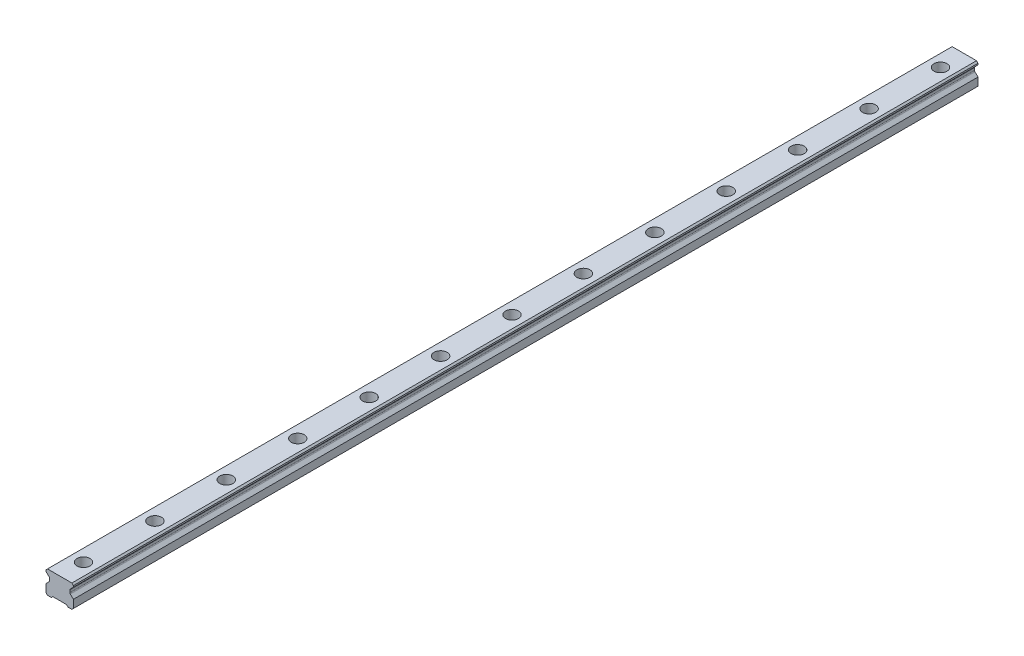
ISO-10303-21;
HEADER;
FILE_DESCRIPTION(('STEP AP214'),'2;1');
FILE_NAME('part.step','',(''),(''),'','','');
FILE_SCHEMA(('AUTOMOTIVE_DESIGN { 1 0 10303 214 1 1 1 1 }'));
ENDSEC;
DATA;
#1=APPLICATION_CONTEXT('core data for automotive mechanical design processes');
#2=APPLICATION_PROTOCOL_DEFINITION('international standard','automotive_design',2000,#1);
#3=PRODUCT_CONTEXT('',#1,'mechanical');
#4=PRODUCT('Part','Part','',(#3));
#5=PRODUCT_RELATED_PRODUCT_CATEGORY('part','',(#4));
#6=PRODUCT_DEFINITION_FORMATION('','',#4);
#7=PRODUCT_DEFINITION_CONTEXT('part definition',#1,'design');
#8=PRODUCT_DEFINITION('design','',#6,#7);
#9=PRODUCT_DEFINITION_SHAPE('','',#8);
#10=(LENGTH_UNIT() NAMED_UNIT(*) SI_UNIT(.MILLI.,.METRE.));
#11=(NAMED_UNIT(*) PLANE_ANGLE_UNIT() SI_UNIT($,.RADIAN.));
#12=(NAMED_UNIT(*) SI_UNIT($,.STERADIAN.) SOLID_ANGLE_UNIT());
#13=UNCERTAINTY_MEASURE_WITH_UNIT(LENGTH_MEASURE(1.E-05),#10,'distance_accuracy_value','');
#14=(GEOMETRIC_REPRESENTATION_CONTEXT(3) GLOBAL_UNCERTAINTY_ASSIGNED_CONTEXT((#13)) GLOBAL_UNIT_ASSIGNED_CONTEXT((#10,
#11,#12)) REPRESENTATION_CONTEXT('',''));
#15=CARTESIAN_POINT('',(0.,0.,0.));
#16=DIRECTION('',(0.,0.,1.));
#17=DIRECTION('',(1.,0.,0.));
#18=AXIS2_PLACEMENT_3D('',#15,#16,#17);
#19=CARTESIAN_POINT('',(0.,10.2,-360.));
#20=DIRECTION('',(0.,1.,0.));
#21=DIRECTION('',(0.,0.,1.));
#22=AXIS2_PLACEMENT_3D('',#19,#20,#21);
#23=PLANE('',#22);
#24=CARTESIAN_POINT('',(0.,10.2,-360.));
#25=DIRECTION('',(0.,1.,0.));
#26=DIRECTION('',(0.,0.,1.));
#27=AXIS2_PLACEMENT_3D('',#24,#25,#26);
#28=CIRCLE('',#27,3.5);
#29=CARTESIAN_POINT('',(0.,10.2,-356.5));
#30=VERTEX_POINT('',#29);
#31=EDGE_CURVE('E445',#30,#30,#28,.T.);
#32=ORIENTED_EDGE('',*,*,#31,.F.);
#33=EDGE_LOOP('',(#32));
#34=FACE_BOUND('',#33,.T.);
#35=CARTESIAN_POINT('',(0.,10.2,-360.));
#36=DIRECTION('',(0.,1.,0.));
#37=DIRECTION('',(0.,0.,1.));
#38=AXIS2_PLACEMENT_3D('',#35,#36,#37);
#39=CIRCLE('',#38,5.5);
#40=CARTESIAN_POINT('',(0.,10.2,-354.5));
#41=VERTEX_POINT('',#40);
#42=EDGE_CURVE('E11',#41,#41,#39,.T.);
#43=ORIENTED_EDGE('',*,*,#42,.T.);
#44=EDGE_LOOP('',(#43));
#45=FACE_BOUND('',#44,.T.);
#46=ADVANCED_FACE('F39',(#34,#45),#23,.T.);
#47=CARTESIAN_POINT('',(0.,10.2,-360.));
#48=DIRECTION('',(0.,1.,0.));
#49=DIRECTION('',(0.,0.,1.));
#50=AXIS2_PLACEMENT_3D('',#47,#48,#49);
#51=CYLINDRICAL_SURFACE('',#50,5.5);
#52=ORIENTED_EDGE('',*,*,#42,.F.);
#53=EDGE_LOOP('',(#52));
#54=FACE_BOUND('',#53,.T.);
#55=CARTESIAN_POINT('',(0.,19.2,-360.));
#56=DIRECTION('',(0.,1.,0.));
#57=DIRECTION('',(0.,0.,1.));
#58=AXIS2_PLACEMENT_3D('',#55,#56,#57);
#59=CIRCLE('',#58,5.5);
#60=CARTESIAN_POINT('',(0.,19.2,-354.5));
#61=VERTEX_POINT('',#60);
#62=EDGE_CURVE('E48',#61,#61,#59,.T.);
#63=ORIENTED_EDGE('',*,*,#62,.T.);
#64=EDGE_LOOP('',(#63));
#65=FACE_BOUND('',#64,.T.);
#66=ADVANCED_FACE('F733',(#54,#65),#51,.F.);
#67=CARTESIAN_POINT('',(0.,10.2,-300.));
#68=DIRECTION('',(0.,1.,0.));
#69=DIRECTION('',(0.,0.,1.));
#70=AXIS2_PLACEMENT_3D('',#67,#68,#69);
#71=PLANE('',#70);
#72=CARTESIAN_POINT('',(0.,10.2,-300.));
#73=DIRECTION('',(0.,1.,0.));
#74=DIRECTION('',(0.,0.,1.));
#75=AXIS2_PLACEMENT_3D('',#72,#73,#74);
#76=CIRCLE('',#75,3.5);
#77=CARTESIAN_POINT('',(0.,10.2,-296.5));
#78=VERTEX_POINT('',#77);
#79=EDGE_CURVE('E450',#78,#78,#76,.T.);
#80=ORIENTED_EDGE('',*,*,#79,.F.);
#81=EDGE_LOOP('',(#80));
#82=FACE_BOUND('',#81,.T.);
#83=CARTESIAN_POINT('',(0.,10.2,-300.));
#84=DIRECTION('',(0.,1.,0.));
#85=DIRECTION('',(0.,0.,1.));
#86=AXIS2_PLACEMENT_3D('',#83,#84,#85);
#87=CIRCLE('',#86,5.5);
#88=CARTESIAN_POINT('',(0.,10.2,-294.5));
#89=VERTEX_POINT('',#88);
#90=EDGE_CURVE('E429',#89,#89,#87,.T.);
#91=ORIENTED_EDGE('',*,*,#90,.T.);
#92=EDGE_LOOP('',(#91));
#93=FACE_BOUND('',#92,.T.);
#94=ADVANCED_FACE('F735',(#82,#93),#71,.T.);
#95=CARTESIAN_POINT('',(0.,10.2,-300.));
#96=DIRECTION('',(0.,1.,0.));
#97=DIRECTION('',(0.,0.,1.));
#98=AXIS2_PLACEMENT_3D('',#95,#96,#97);
#99=CYLINDRICAL_SURFACE('',#98,5.5);
#100=ORIENTED_EDGE('',*,*,#90,.F.);
#101=EDGE_LOOP('',(#100));
#102=FACE_BOUND('',#101,.T.);
#103=CARTESIAN_POINT('',(0.,19.2,-300.));
#104=DIRECTION('',(0.,1.,0.));
#105=DIRECTION('',(0.,0.,1.));
#106=AXIS2_PLACEMENT_3D('',#103,#104,#105);
#107=CIRCLE('',#106,5.5);
#108=CARTESIAN_POINT('',(0.,19.2,-294.5));
#109=VERTEX_POINT('',#108);
#110=EDGE_CURVE('E425',#109,#109,#107,.T.);
#111=ORIENTED_EDGE('',*,*,#110,.T.);
#112=EDGE_LOOP('',(#111));
#113=FACE_BOUND('',#112,.T.);
#114=ADVANCED_FACE('F741',(#102,#113),#99,.F.);
#115=CARTESIAN_POINT('',(0.,10.2,-240.));
#116=DIRECTION('',(0.,1.,0.));
#117=DIRECTION('',(0.,0.,1.));
#118=AXIS2_PLACEMENT_3D('',#115,#116,#117);
#119=PLANE('',#118);
#120=CARTESIAN_POINT('',(0.,10.2,-240.));
#121=DIRECTION('',(0.,1.,0.));
#122=DIRECTION('',(0.,0.,1.));
#123=AXIS2_PLACEMENT_3D('',#120,#121,#122);
#124=CIRCLE('',#123,3.5);
#125=CARTESIAN_POINT('',(0.,10.2,-236.5));
#126=VERTEX_POINT('',#125);
#127=EDGE_CURVE('E455',#126,#126,#124,.T.);
#128=ORIENTED_EDGE('',*,*,#127,.F.);
#129=EDGE_LOOP('',(#128));
#130=FACE_BOUND('',#129,.T.);
#131=CARTESIAN_POINT('',(0.,10.2,-240.));
#132=DIRECTION('',(0.,1.,0.));
#133=DIRECTION('',(0.,0.,1.));
#134=AXIS2_PLACEMENT_3D('',#131,#132,#133);
#135=CIRCLE('',#134,5.5);
#136=CARTESIAN_POINT('',(0.,10.2,-234.5));
#137=VERTEX_POINT('',#136);
#138=EDGE_CURVE('E421',#137,#137,#135,.T.);
#139=ORIENTED_EDGE('',*,*,#138,.T.);
#140=EDGE_LOOP('',(#139));
#141=FACE_BOUND('',#140,.T.);
#142=ADVANCED_FACE('F749',(#130,#141),#119,.T.);
#143=CARTESIAN_POINT('',(0.,10.2,-240.));
#144=DIRECTION('',(0.,1.,0.));
#145=DIRECTION('',(0.,0.,1.));
#146=AXIS2_PLACEMENT_3D('',#143,#144,#145);
#147=CYLINDRICAL_SURFACE('',#146,5.5);
#148=ORIENTED_EDGE('',*,*,#138,.F.);
#149=EDGE_LOOP('',(#148));
#150=FACE_BOUND('',#149,.T.);
#151=CARTESIAN_POINT('',(0.,19.2,-240.));
#152=DIRECTION('',(0.,1.,0.));
#153=DIRECTION('',(0.,0.,1.));
#154=AXIS2_PLACEMENT_3D('',#151,#152,#153);
#155=CIRCLE('',#154,5.5);
#156=CARTESIAN_POINT('',(0.,19.2,-234.5));
#157=VERTEX_POINT('',#156);
#158=EDGE_CURVE('E417',#157,#157,#155,.T.);
#159=ORIENTED_EDGE('',*,*,#158,.T.);
#160=EDGE_LOOP('',(#159));
#161=FACE_BOUND('',#160,.T.);
#162=ADVANCED_FACE('F753',(#150,#161),#147,.F.);
#163=CARTESIAN_POINT('',(0.,10.2,-180.));
#164=DIRECTION('',(0.,1.,0.));
#165=DIRECTION('',(0.,0.,1.));
#166=AXIS2_PLACEMENT_3D('',#163,#164,#165);
#167=PLANE('',#166);
#168=CARTESIAN_POINT('',(0.,10.2,-180.));
#169=DIRECTION('',(0.,1.,0.));
#170=DIRECTION('',(0.,0.,1.));
#171=AXIS2_PLACEMENT_3D('',#168,#169,#170);
#172=CIRCLE('',#171,3.5);
#173=CARTESIAN_POINT('',(0.,10.2,-176.5));
#174=VERTEX_POINT('',#173);
#175=EDGE_CURVE('E460',#174,#174,#172,.T.);
#176=ORIENTED_EDGE('',*,*,#175,.F.);
#177=EDGE_LOOP('',(#176));
#178=FACE_BOUND('',#177,.T.);
#179=CARTESIAN_POINT('',(0.,10.2,-180.));
#180=DIRECTION('',(0.,1.,0.));
#181=DIRECTION('',(0.,0.,1.));
#182=AXIS2_PLACEMENT_3D('',#179,#180,#181);
#183=CIRCLE('',#182,5.5);
#184=CARTESIAN_POINT('',(0.,10.2,-174.5));
#185=VERTEX_POINT('',#184);
#186=EDGE_CURVE('E413',#185,#185,#183,.T.);
#187=ORIENTED_EDGE('',*,*,#186,.T.);
#188=EDGE_LOOP('',(#187));
#189=FACE_BOUND('',#188,.T.);
#190=ADVANCED_FACE('F757',(#178,#189),#167,.T.);
#191=CARTESIAN_POINT('',(0.,10.2,-180.));
#192=DIRECTION('',(0.,1.,0.));
#193=DIRECTION('',(0.,0.,1.));
#194=AXIS2_PLACEMENT_3D('',#191,#192,#193);
#195=CYLINDRICAL_SURFACE('',#194,5.5);
#196=ORIENTED_EDGE('',*,*,#186,.F.);
#197=EDGE_LOOP('',(#196));
#198=FACE_BOUND('',#197,.T.);
#199=CARTESIAN_POINT('',(0.,19.2,-180.));
#200=DIRECTION('',(0.,1.,0.));
#201=DIRECTION('',(0.,0.,1.));
#202=AXIS2_PLACEMENT_3D('',#199,#200,#201);
#203=CIRCLE('',#202,5.5);
#204=CARTESIAN_POINT('',(0.,19.2,-174.5));
#205=VERTEX_POINT('',#204);
#206=EDGE_CURVE('E409',#205,#205,#203,.T.);
#207=ORIENTED_EDGE('',*,*,#206,.T.);
#208=EDGE_LOOP('',(#207));
#209=FACE_BOUND('',#208,.T.);
#210=ADVANCED_FACE('F761',(#198,#209),#195,.F.);
#211=CARTESIAN_POINT('',(0.,10.2,-120.));
#212=DIRECTION('',(0.,1.,0.));
#213=DIRECTION('',(0.,0.,1.));
#214=AXIS2_PLACEMENT_3D('',#211,#212,#213);
#215=PLANE('',#214);
#216=CARTESIAN_POINT('',(0.,10.2,-120.));
#217=DIRECTION('',(0.,1.,0.));
#218=DIRECTION('',(0.,0.,1.));
#219=AXIS2_PLACEMENT_3D('',#216,#217,#218);
#220=CIRCLE('',#219,3.5);
#221=CARTESIAN_POINT('',(0.,10.2,-116.5));
#222=VERTEX_POINT('',#221);
#223=EDGE_CURVE('E465',#222,#222,#220,.T.);
#224=ORIENTED_EDGE('',*,*,#223,.F.);
#225=EDGE_LOOP('',(#224));
#226=FACE_BOUND('',#225,.T.);
#227=CARTESIAN_POINT('',(0.,10.2,-120.));
#228=DIRECTION('',(0.,1.,0.));
#229=DIRECTION('',(0.,0.,1.));
#230=AXIS2_PLACEMENT_3D('',#227,#228,#229);
#231=CIRCLE('',#230,5.5);
#232=CARTESIAN_POINT('',(0.,10.2,-114.5));
#233=VERTEX_POINT('',#232);
#234=EDGE_CURVE('E405',#233,#233,#231,.T.);
#235=ORIENTED_EDGE('',*,*,#234,.T.);
#236=EDGE_LOOP('',(#235));
#237=FACE_BOUND('',#236,.T.);
#238=ADVANCED_FACE('F765',(#226,#237),#215,.T.);
#239=CARTESIAN_POINT('',(0.,10.2,-120.));
#240=DIRECTION('',(0.,1.,0.));
#241=DIRECTION('',(0.,0.,1.));
#242=AXIS2_PLACEMENT_3D('',#239,#240,#241);
#243=CYLINDRICAL_SURFACE('',#242,5.5);
#244=ORIENTED_EDGE('',*,*,#234,.F.);
#245=EDGE_LOOP('',(#244));
#246=FACE_BOUND('',#245,.T.);
#247=CARTESIAN_POINT('',(0.,19.2,-120.));
#248=DIRECTION('',(0.,1.,0.));
#249=DIRECTION('',(0.,0.,1.));
#250=AXIS2_PLACEMENT_3D('',#247,#248,#249);
#251=CIRCLE('',#250,5.5);
#252=CARTESIAN_POINT('',(0.,19.2,-114.5));
#253=VERTEX_POINT('',#252);
#254=EDGE_CURVE('E401',#253,#253,#251,.T.);
#255=ORIENTED_EDGE('',*,*,#254,.T.);
#256=EDGE_LOOP('',(#255));
#257=FACE_BOUND('',#256,.T.);
#258=ADVANCED_FACE('F769',(#246,#257),#243,.F.);
#259=CARTESIAN_POINT('',(0.,10.2,-60.));
#260=DIRECTION('',(0.,1.,0.));
#261=DIRECTION('',(0.,0.,1.));
#262=AXIS2_PLACEMENT_3D('',#259,#260,#261);
#263=PLANE('',#262);
#264=CARTESIAN_POINT('',(0.,10.2,-60.));
#265=DIRECTION('',(0.,1.,0.));
#266=DIRECTION('',(0.,0.,1.));
#267=AXIS2_PLACEMENT_3D('',#264,#265,#266);
#268=CIRCLE('',#267,3.5);
#269=CARTESIAN_POINT('',(0.,10.2,-56.5));
#270=VERTEX_POINT('',#269);
#271=EDGE_CURVE('E470',#270,#270,#268,.T.);
#272=ORIENTED_EDGE('',*,*,#271,.F.);
#273=EDGE_LOOP('',(#272));
#274=FACE_BOUND('',#273,.T.);
#275=CARTESIAN_POINT('',(0.,10.2,-60.));
#276=DIRECTION('',(0.,1.,0.));
#277=DIRECTION('',(0.,0.,1.));
#278=AXIS2_PLACEMENT_3D('',#275,#276,#277);
#279=CIRCLE('',#278,5.5);
#280=CARTESIAN_POINT('',(0.,10.2,-54.5));
#281=VERTEX_POINT('',#280);
#282=EDGE_CURVE('E397',#281,#281,#279,.T.);
#283=ORIENTED_EDGE('',*,*,#282,.T.);
#284=EDGE_LOOP('',(#283));
#285=FACE_BOUND('',#284,.T.);
#286=ADVANCED_FACE('F773',(#274,#285),#263,.T.);
#287=CARTESIAN_POINT('',(0.,10.2,-60.));
#288=DIRECTION('',(0.,1.,0.));
#289=DIRECTION('',(0.,0.,1.));
#290=AXIS2_PLACEMENT_3D('',#287,#288,#289);
#291=CYLINDRICAL_SURFACE('',#290,5.5);
#292=ORIENTED_EDGE('',*,*,#282,.F.);
#293=EDGE_LOOP('',(#292));
#294=FACE_BOUND('',#293,.T.);
#295=CARTESIAN_POINT('',(0.,19.2,-60.));
#296=DIRECTION('',(0.,1.,0.));
#297=DIRECTION('',(0.,0.,1.));
#298=AXIS2_PLACEMENT_3D('',#295,#296,#297);
#299=CIRCLE('',#298,5.5);
#300=CARTESIAN_POINT('',(0.,19.2,-54.5));
#301=VERTEX_POINT('',#300);
#302=EDGE_CURVE('E393',#301,#301,#299,.T.);
#303=ORIENTED_EDGE('',*,*,#302,.T.);
#304=EDGE_LOOP('',(#303));
#305=FACE_BOUND('',#304,.T.);
#306=ADVANCED_FACE('F705',(#294,#305),#291,.F.);
#307=CARTESIAN_POINT('',(0.,10.2,0.));
#308=DIRECTION('',(0.,1.,0.));
#309=DIRECTION('',(0.,0.,1.));
#310=AXIS2_PLACEMENT_3D('',#307,#308,#309);
#311=PLANE('',#310);
#312=CARTESIAN_POINT('',(0.,10.2,0.));
#313=DIRECTION('',(0.,1.,0.));
#314=DIRECTION('',(0.,0.,1.));
#315=AXIS2_PLACEMENT_3D('',#312,#313,#314);
#316=CIRCLE('',#315,3.5);
#317=CARTESIAN_POINT('',(0.,10.2,3.5));
#318=VERTEX_POINT('',#317);
#319=EDGE_CURVE('E475',#318,#318,#316,.T.);
#320=ORIENTED_EDGE('',*,*,#319,.F.);
#321=EDGE_LOOP('',(#320));
#322=FACE_BOUND('',#321,.T.);
#323=CARTESIAN_POINT('',(0.,10.2,0.));
#324=DIRECTION('',(0.,1.,0.));
#325=DIRECTION('',(0.,0.,1.));
#326=AXIS2_PLACEMENT_3D('',#323,#324,#325);
#327=CIRCLE('',#326,5.5);
#328=CARTESIAN_POINT('',(0.,10.2,5.5));
#329=VERTEX_POINT('',#328);
#330=EDGE_CURVE('E389',#329,#329,#327,.T.);
#331=ORIENTED_EDGE('',*,*,#330,.T.);
#332=EDGE_LOOP('',(#331));
#333=FACE_BOUND('',#332,.T.);
#334=ADVANCED_FACE('F701',(#322,#333),#311,.T.);
#335=CARTESIAN_POINT('',(0.,10.2,0.));
#336=DIRECTION('',(0.,1.,0.));
#337=DIRECTION('',(0.,0.,1.));
#338=AXIS2_PLACEMENT_3D('',#335,#336,#337);
#339=CYLINDRICAL_SURFACE('',#338,5.5);
#340=ORIENTED_EDGE('',*,*,#330,.F.);
#341=EDGE_LOOP('',(#340));
#342=FACE_BOUND('',#341,.T.);
#343=CARTESIAN_POINT('',(0.,19.2,0.));
#344=DIRECTION('',(0.,1.,0.));
#345=DIRECTION('',(0.,0.,1.));
#346=AXIS2_PLACEMENT_3D('',#343,#344,#345);
#347=CIRCLE('',#346,5.5);
#348=CARTESIAN_POINT('',(0.,19.2,5.5));
#349=VERTEX_POINT('',#348);
#350=EDGE_CURVE('E385',#349,#349,#347,.T.);
#351=ORIENTED_EDGE('',*,*,#350,.T.);
#352=EDGE_LOOP('',(#351));
#353=FACE_BOUND('',#352,.T.);
#354=ADVANCED_FACE('F704',(#342,#353),#339,.F.);
#355=CARTESIAN_POINT('',(0.,10.2,60.));
#356=DIRECTION('',(0.,1.,0.));
#357=DIRECTION('',(0.,0.,1.));
#358=AXIS2_PLACEMENT_3D('',#355,#356,#357);
#359=PLANE('',#358);
#360=CARTESIAN_POINT('',(0.,10.2,60.));
#361=DIRECTION('',(0.,1.,0.));
#362=DIRECTION('',(0.,0.,1.));
#363=AXIS2_PLACEMENT_3D('',#360,#361,#362);
#364=CIRCLE('',#363,3.5);
#365=CARTESIAN_POINT('',(0.,10.2,63.5));
#366=VERTEX_POINT('',#365);
#367=EDGE_CURVE('E480',#366,#366,#364,.T.);
#368=ORIENTED_EDGE('',*,*,#367,.F.);
#369=EDGE_LOOP('',(#368));
#370=FACE_BOUND('',#369,.T.);
#371=CARTESIAN_POINT('',(0.,10.2,60.));
#372=DIRECTION('',(0.,1.,0.));
#373=DIRECTION('',(0.,0.,1.));
#374=AXIS2_PLACEMENT_3D('',#371,#372,#373);
#375=CIRCLE('',#374,5.5);
#376=CARTESIAN_POINT('',(0.,10.2,65.5));
#377=VERTEX_POINT('',#376);
#378=EDGE_CURVE('E381',#377,#377,#375,.T.);
#379=ORIENTED_EDGE('',*,*,#378,.T.);
#380=EDGE_LOOP('',(#379));
#381=FACE_BOUND('',#380,.T.);
#382=ADVANCED_FACE('F711',(#370,#381),#359,.T.);
#383=CARTESIAN_POINT('',(0.,10.2,60.));
#384=DIRECTION('',(0.,1.,0.));
#385=DIRECTION('',(0.,0.,1.));
#386=AXIS2_PLACEMENT_3D('',#383,#384,#385);
#387=CYLINDRICAL_SURFACE('',#386,5.5);
#388=ORIENTED_EDGE('',*,*,#378,.F.);
#389=EDGE_LOOP('',(#388));
#390=FACE_BOUND('',#389,.T.);
#391=CARTESIAN_POINT('',(0.,19.2,60.));
#392=DIRECTION('',(0.,1.,0.));
#393=DIRECTION('',(0.,0.,1.));
#394=AXIS2_PLACEMENT_3D('',#391,#392,#393);
#395=CIRCLE('',#394,5.5);
#396=CARTESIAN_POINT('',(0.,19.2,65.5));
#397=VERTEX_POINT('',#396);
#398=EDGE_CURVE('E377',#397,#397,#395,.T.);
#399=ORIENTED_EDGE('',*,*,#398,.T.);
#400=EDGE_LOOP('',(#399));
#401=FACE_BOUND('',#400,.T.);
#402=ADVANCED_FACE('F783',(#390,#401),#387,.F.);
#403=CARTESIAN_POINT('',(0.,10.2,120.));
#404=DIRECTION('',(0.,1.,0.));
#405=DIRECTION('',(0.,0.,1.));
#406=AXIS2_PLACEMENT_3D('',#403,#404,#405);
#407=PLANE('',#406);
#408=CARTESIAN_POINT('',(0.,10.2,120.));
#409=DIRECTION('',(0.,1.,0.));
#410=DIRECTION('',(0.,0.,1.));
#411=AXIS2_PLACEMENT_3D('',#408,#409,#410);
#412=CIRCLE('',#411,3.5);
#413=CARTESIAN_POINT('',(0.,10.2,123.5));
#414=VERTEX_POINT('',#413);
#415=EDGE_CURVE('E484',#414,#414,#412,.T.);
#416=ORIENTED_EDGE('',*,*,#415,.F.);
#417=EDGE_LOOP('',(#416));
#418=FACE_BOUND('',#417,.T.);
#419=CARTESIAN_POINT('',(0.,10.2,120.));
#420=DIRECTION('',(0.,1.,0.));
#421=DIRECTION('',(0.,0.,1.));
#422=AXIS2_PLACEMENT_3D('',#419,#420,#421);
#423=CIRCLE('',#422,5.5);
#424=CARTESIAN_POINT('',(0.,10.2,125.5));
#425=VERTEX_POINT('',#424);
#426=EDGE_CURVE('E373',#425,#425,#423,.T.);
#427=ORIENTED_EDGE('',*,*,#426,.T.);
#428=EDGE_LOOP('',(#427));
#429=FACE_BOUND('',#428,.T.);
#430=ADVANCED_FACE('F787',(#418,#429),#407,.T.);
#431=CARTESIAN_POINT('',(0.,10.2,120.));
#432=DIRECTION('',(0.,1.,0.));
#433=DIRECTION('',(0.,0.,1.));
#434=AXIS2_PLACEMENT_3D('',#431,#432,#433);
#435=CYLINDRICAL_SURFACE('',#434,5.5);
#436=ORIENTED_EDGE('',*,*,#426,.F.);
#437=EDGE_LOOP('',(#436));
#438=FACE_BOUND('',#437,.T.);
#439=CARTESIAN_POINT('',(0.,19.2,120.));
#440=DIRECTION('',(0.,1.,0.));
#441=DIRECTION('',(0.,0.,1.));
#442=AXIS2_PLACEMENT_3D('',#439,#440,#441);
#443=CIRCLE('',#442,5.5);
#444=CARTESIAN_POINT('',(0.,19.2,125.5));
#445=VERTEX_POINT('',#444);
#446=EDGE_CURVE('E369',#445,#445,#443,.T.);
#447=ORIENTED_EDGE('',*,*,#446,.T.);
#448=EDGE_LOOP('',(#447));
#449=FACE_BOUND('',#448,.T.);
#450=ADVANCED_FACE('F791',(#438,#449),#435,.F.);
#451=CARTESIAN_POINT('',(0.,10.2,180.));
#452=DIRECTION('',(0.,1.,0.));
#453=DIRECTION('',(0.,0.,1.));
#454=AXIS2_PLACEMENT_3D('',#451,#452,#453);
#455=PLANE('',#454);
#456=CARTESIAN_POINT('',(0.,10.2,180.));
#457=DIRECTION('',(0.,1.,0.));
#458=DIRECTION('',(0.,0.,1.));
#459=AXIS2_PLACEMENT_3D('',#456,#457,#458);
#460=CIRCLE('',#459,3.5);
#461=CARTESIAN_POINT('',(0.,10.2,183.5));
#462=VERTEX_POINT('',#461);
#463=EDGE_CURVE('E488',#462,#462,#460,.T.);
#464=ORIENTED_EDGE('',*,*,#463,.F.);
#465=EDGE_LOOP('',(#464));
#466=FACE_BOUND('',#465,.T.);
#467=CARTESIAN_POINT('',(0.,10.2,180.));
#468=DIRECTION('',(0.,1.,0.));
#469=DIRECTION('',(0.,0.,1.));
#470=AXIS2_PLACEMENT_3D('',#467,#468,#469);
#471=CIRCLE('',#470,5.5);
#472=CARTESIAN_POINT('',(0.,10.2,185.5));
#473=VERTEX_POINT('',#472);
#474=EDGE_CURVE('E366',#473,#473,#471,.T.);
#475=ORIENTED_EDGE('',*,*,#474,.T.);
#476=EDGE_LOOP('',(#475));
#477=FACE_BOUND('',#476,.T.);
#478=ADVANCED_FACE('F795',(#466,#477),#455,.T.);
#479=CARTESIAN_POINT('',(0.,10.2,180.));
#480=DIRECTION('',(0.,1.,0.));
#481=DIRECTION('',(0.,0.,1.));
#482=AXIS2_PLACEMENT_3D('',#479,#480,#481);
#483=CYLINDRICAL_SURFACE('',#482,5.5);
#484=ORIENTED_EDGE('',*,*,#474,.F.);
#485=EDGE_LOOP('',(#484));
#486=FACE_BOUND('',#485,.T.);
#487=CARTESIAN_POINT('',(0.,19.2,180.));
#488=DIRECTION('',(0.,1.,0.));
#489=DIRECTION('',(0.,0.,1.));
#490=AXIS2_PLACEMENT_3D('',#487,#488,#489);
#491=CIRCLE('',#490,5.5);
#492=CARTESIAN_POINT('',(0.,19.2,185.5));
#493=VERTEX_POINT('',#492);
#494=EDGE_CURVE('E362',#493,#493,#491,.T.);
#495=ORIENTED_EDGE('',*,*,#494,.T.);
#496=EDGE_LOOP('',(#495));
#497=FACE_BOUND('',#496,.T.);
#498=ADVANCED_FACE('F799',(#486,#497),#483,.F.);
#499=CARTESIAN_POINT('',(0.,10.2,240.));
#500=DIRECTION('',(0.,1.,0.));
#501=DIRECTION('',(0.,0.,1.));
#502=AXIS2_PLACEMENT_3D('',#499,#500,#501);
#503=PLANE('',#502);
#504=CARTESIAN_POINT('',(0.,10.2,240.));
#505=DIRECTION('',(0.,1.,0.));
#506=DIRECTION('',(0.,0.,1.));
#507=AXIS2_PLACEMENT_3D('',#504,#505,#506);
#508=CIRCLE('',#507,3.5);
#509=CARTESIAN_POINT('',(0.,10.2,243.5));
#510=VERTEX_POINT('',#509);
#511=EDGE_CURVE('E505',#510,#510,#508,.T.);
#512=ORIENTED_EDGE('',*,*,#511,.F.);
#513=EDGE_LOOP('',(#512));
#514=FACE_BOUND('',#513,.T.);
#515=CARTESIAN_POINT('',(0.,10.2,240.));
#516=DIRECTION('',(0.,1.,0.));
#517=DIRECTION('',(0.,0.,1.));
#518=AXIS2_PLACEMENT_3D('',#515,#516,#517);
#519=CIRCLE('',#518,5.5);
#520=CARTESIAN_POINT('',(0.,10.2,245.5));
#521=VERTEX_POINT('',#520);
#522=EDGE_CURVE('E358',#521,#521,#519,.T.);
#523=ORIENTED_EDGE('',*,*,#522,.T.);
#524=EDGE_LOOP('',(#523));
#525=FACE_BOUND('',#524,.T.);
#526=ADVANCED_FACE('F803',(#514,#525),#503,.T.);
#527=CARTESIAN_POINT('',(0.,10.2,240.));
#528=DIRECTION('',(0.,1.,0.));
#529=DIRECTION('',(0.,0.,1.));
#530=AXIS2_PLACEMENT_3D('',#527,#528,#529);
#531=CYLINDRICAL_SURFACE('',#530,5.5);
#532=ORIENTED_EDGE('',*,*,#522,.F.);
#533=EDGE_LOOP('',(#532));
#534=FACE_BOUND('',#533,.T.);
#535=CARTESIAN_POINT('',(0.,19.2,240.));
#536=DIRECTION('',(0.,1.,0.));
#537=DIRECTION('',(0.,0.,1.));
#538=AXIS2_PLACEMENT_3D('',#535,#536,#537);
#539=CIRCLE('',#538,5.5);
#540=CARTESIAN_POINT('',(0.,19.2,245.5));
#541=VERTEX_POINT('',#540);
#542=EDGE_CURVE('E354',#541,#541,#539,.T.);
#543=ORIENTED_EDGE('',*,*,#542,.T.);
#544=EDGE_LOOP('',(#543));
#545=FACE_BOUND('',#544,.T.);
#546=ADVANCED_FACE('F807',(#534,#545),#531,.F.);
#547=CARTESIAN_POINT('',(11.5,0.,380.));
#548=DIRECTION('',(0.,1.,0.));
#549=DIRECTION('',(-1.,0.,0.));
#550=AXIS2_PLACEMENT_3D('',#547,#548,#549);
#551=PLANE('',#550);
#552=DIRECTION('',(1.,0.,0.));
#553=VECTOR('',#552,1.);
#554=CARTESIAN_POINT('',(11.5,0.,-380.));
#555=LINE('',#554,#553);
#556=CARTESIAN_POINT('',(-10.25,0.,-380.));
#557=VERTEX_POINT('',#556);
#558=CARTESIAN_POINT('',(-7.,0.,-380.));
#559=VERTEX_POINT('',#558);
#560=EDGE_CURVE('E229',#557,#559,#555,.T.);
#561=ORIENTED_EDGE('',*,*,#560,.T.);
#562=DIRECTION('',(0.,0.,1.));
#563=VECTOR('',#562,1.);
#564=CARTESIAN_POINT('',(-7.,0.,-380.));
#565=LINE('',#564,#563);
#566=CARTESIAN_POINT('',(-7.,0.,380.));
#567=VERTEX_POINT('',#566);
#568=EDGE_CURVE('E545',#559,#567,#565,.T.);
#569=ORIENTED_EDGE('',*,*,#568,.T.);
#570=DIRECTION('',(1.,0.,0.));
#571=VECTOR('',#570,1.);
#572=CARTESIAN_POINT('',(11.5,0.,380.));
#573=LINE('',#572,#571);
#574=CARTESIAN_POINT('',(-10.25,0.,380.));
#575=VERTEX_POINT('',#574);
#576=EDGE_CURVE('E614',#575,#567,#573,.T.);
#577=ORIENTED_EDGE('',*,*,#576,.F.);
#578=DIRECTION('',(0.,0.,-1.));
#579=VECTOR('',#578,1.);
#580=CARTESIAN_POINT('',(-10.25,0.,380.));
#581=LINE('',#580,#579);
#582=EDGE_CURVE('E290',#575,#557,#581,.T.);
#583=ORIENTED_EDGE('',*,*,#582,.T.);
#584=EDGE_LOOP('',(#561,#569,#577,#583));
#585=FACE_BOUND('',#584,.T.);
#586=ADVANCED_FACE('F811',(#585),#551,.F.);
#587=CARTESIAN_POINT('',(-11.5,19.2,380.));
#588=DIRECTION('',(1.,0.,0.));
#589=DIRECTION('',(0.,1.,0.));
#590=AXIS2_PLACEMENT_3D('',#587,#588,#589);
#591=PLANE('',#590);
#592=DIRECTION('',(0.,-1.,0.));
#593=VECTOR('',#592,1.);
#594=CARTESIAN_POINT('',(-11.5,19.2,380.));
#595=LINE('',#594,#593);
#596=CARTESIAN_POINT('',(-11.5,17.95,380.));
#597=VERTEX_POINT('',#596);
#598=CARTESIAN_POINT('',(-11.5,16.7,380.));
#599=VERTEX_POINT('',#598);
#600=EDGE_CURVE('E610',#597,#599,#595,.T.);
#601=ORIENTED_EDGE('',*,*,#600,.F.);
#602=DIRECTION('',(0.,0.,-1.));
#603=VECTOR('',#602,1.);
#604=CARTESIAN_POINT('',(-11.5,17.95,380.));
#605=LINE('',#604,#603);
#606=CARTESIAN_POINT('',(-11.5,17.95,-380.));
#607=VERTEX_POINT('',#606);
#608=EDGE_CURVE('E252',#597,#607,#605,.T.);
#609=ORIENTED_EDGE('',*,*,#608,.T.);
#610=DIRECTION('',(0.,-1.,0.));
#611=VECTOR('',#610,1.);
#612=CARTESIAN_POINT('',(-11.5,19.2,-380.));
#613=LINE('',#612,#611);
#614=CARTESIAN_POINT('',(-11.5,16.7,-380.));
#615=VERTEX_POINT('',#614);
#616=EDGE_CURVE('E230',#607,#615,#613,.T.);
#617=ORIENTED_EDGE('',*,*,#616,.T.);
#618=DIRECTION('',(0.,0.,1.));
#619=VECTOR('',#618,1.);
#620=CARTESIAN_POINT('',(-11.5,16.7,-380.));
#621=LINE('',#620,#619);
#622=EDGE_CURVE('E565',#615,#599,#621,.T.);
#623=ORIENTED_EDGE('',*,*,#622,.T.);
#624=EDGE_LOOP('',(#601,#609,#617,#623));
#625=FACE_BOUND('',#624,.T.);
#626=ADVANCED_FACE('F639',(#625),#591,.F.);
#627=CARTESIAN_POINT('',(11.5,19.2,380.));
#628=DIRECTION('',(-1.,0.,0.));
#629=DIRECTION('',(0.,0.,1.));
#630=AXIS2_PLACEMENT_3D('',#627,#628,#629);
#631=PLANE('',#630);
#632=DIRECTION('',(0.,1.,0.));
#633=VECTOR('',#632,1.);
#634=CARTESIAN_POINT('',(11.5,19.2,380.));
#635=LINE('',#634,#633);
#636=CARTESIAN_POINT('',(11.5,1.24999999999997,380.));
#637=VERTEX_POINT('',#636);
#638=CARTESIAN_POINT('',(11.5,7.95,380.));
#639=VERTEX_POINT('',#638);
#640=EDGE_CURVE('E619',#637,#639,#635,.T.);
#641=ORIENTED_EDGE('',*,*,#640,.F.);
#642=DIRECTION('',(0.,0.,-1.));
#643=VECTOR('',#642,1.);
#644=CARTESIAN_POINT('',(11.5,1.24999999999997,380.));
#645=LINE('',#644,#643);
#646=CARTESIAN_POINT('',(11.5,1.24999999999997,-380.));
#647=VERTEX_POINT('',#646);
#648=EDGE_CURVE('E297',#637,#647,#645,.T.);
#649=ORIENTED_EDGE('',*,*,#648,.T.);
#650=DIRECTION('',(0.,1.,0.));
#651=VECTOR('',#650,1.);
#652=CARTESIAN_POINT('',(11.5,19.2,-380.));
#653=LINE('',#652,#651);
#654=CARTESIAN_POINT('',(11.5,7.95,-380.));
#655=VERTEX_POINT('',#654);
#656=EDGE_CURVE('E243',#647,#655,#653,.T.);
#657=ORIENTED_EDGE('',*,*,#656,.T.);
#658=DIRECTION('',(0.,0.,1.));
#659=VECTOR('',#658,1.);
#660=CARTESIAN_POINT('',(11.5,7.95,-380.));
#661=LINE('',#660,#659);
#662=EDGE_CURVE('E595',#655,#639,#661,.T.);
#663=ORIENTED_EDGE('',*,*,#662,.T.);
#664=EDGE_LOOP('',(#641,#649,#657,#663));
#665=FACE_BOUND('',#664,.T.);
#666=ADVANCED_FACE('F842',(#665),#631,.F.);
#667=CARTESIAN_POINT('',(-11.5,7.95,-380.));
#668=VERTEX_POINT('',#667);
#669=CARTESIAN_POINT('',(-11.5,1.24999999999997,-380.));
#670=VERTEX_POINT('',#669);
#671=EDGE_CURVE('E239',#668,#670,#613,.T.);
#672=ORIENTED_EDGE('',*,*,#671,.T.);
#673=DIRECTION('',(0.,0.,1.));
#674=VECTOR('',#673,1.);
#675=CARTESIAN_POINT('',(-11.5,1.24999999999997,380.));
#676=LINE('',#675,#674);
#677=CARTESIAN_POINT('',(-11.5,1.24999999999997,380.));
#678=VERTEX_POINT('',#677);
#679=EDGE_CURVE('E294',#670,#678,#676,.T.);
#680=ORIENTED_EDGE('',*,*,#679,.T.);
#681=CARTESIAN_POINT('',(-11.5,7.95,380.));
#682=VERTEX_POINT('',#681);
#683=EDGE_CURVE('E251',#682,#678,#595,.T.);
#684=ORIENTED_EDGE('',*,*,#683,.F.);
#685=DIRECTION('',(0.,0.,1.));
#686=VECTOR('',#685,1.);
#687=CARTESIAN_POINT('',(-11.5,7.95,-380.));
#688=LINE('',#687,#686);
#689=EDGE_CURVE('E577',#668,#682,#688,.T.);
#690=ORIENTED_EDGE('',*,*,#689,.F.);
#691=EDGE_LOOP('',(#672,#680,#684,#690));
#692=FACE_BOUND('',#691,.T.);
#693=ADVANCED_FACE('F667',(#692),#591,.F.);
#694=CARTESIAN_POINT('',(7.,0.,380.));
#695=VERTEX_POINT('',#694);
#696=CARTESIAN_POINT('',(10.25,0.,380.));
#697=VERTEX_POINT('',#696);
#698=EDGE_CURVE('E219',#695,#697,#573,.T.);
#699=ORIENTED_EDGE('',*,*,#698,.F.);
#700=DIRECTION('',(0.,0.,1.));
#701=VECTOR('',#700,1.);
#702=CARTESIAN_POINT('',(7.,0.,-380.));
#703=LINE('',#702,#701);
#704=CARTESIAN_POINT('',(7.,0.,-380.));
#705=VERTEX_POINT('',#704);
#706=EDGE_CURVE('E206',#705,#695,#703,.T.);
#707=ORIENTED_EDGE('',*,*,#706,.F.);
#708=CARTESIAN_POINT('',(10.25,0.,-380.));
#709=VERTEX_POINT('',#708);
#710=EDGE_CURVE('E217',#705,#709,#555,.T.);
#711=ORIENTED_EDGE('',*,*,#710,.T.);
#712=DIRECTION('',(0.,0.,1.));
#713=VECTOR('',#712,1.);
#714=CARTESIAN_POINT('',(10.25,0.,380.));
#715=LINE('',#714,#713);
#716=EDGE_CURVE('E287',#709,#697,#715,.T.);
#717=ORIENTED_EDGE('',*,*,#716,.T.);
#718=EDGE_LOOP('',(#699,#707,#711,#717));
#719=FACE_BOUND('',#718,.T.);
#720=ADVANCED_FACE('F215',(#719),#551,.F.);
#721=CARTESIAN_POINT('',(11.5,16.7,-380.));
#722=VERTEX_POINT('',#721);
#723=CARTESIAN_POINT('',(11.5,17.9500000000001,-380.));
#724=VERTEX_POINT('',#723);
#725=EDGE_CURVE('E236',#722,#724,#653,.T.);
#726=ORIENTED_EDGE('',*,*,#725,.T.);
#727=DIRECTION('',(0.,0.,1.));
#728=VECTOR('',#727,1.);
#729=CARTESIAN_POINT('',(11.5,17.9500000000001,380.));
#730=LINE('',#729,#728);
#731=CARTESIAN_POINT('',(11.5,17.9500000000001,380.));
#732=VERTEX_POINT('',#731);
#733=EDGE_CURVE('E301',#724,#732,#730,.T.);
#734=ORIENTED_EDGE('',*,*,#733,.T.);
#735=CARTESIAN_POINT('',(11.5,16.7,380.));
#736=VERTEX_POINT('',#735);
#737=EDGE_CURVE('E618',#736,#732,#635,.T.);
#738=ORIENTED_EDGE('',*,*,#737,.F.);
#739=DIRECTION('',(0.,0.,1.));
#740=VECTOR('',#739,1.);
#741=CARTESIAN_POINT('',(11.5,16.7,-380.));
#742=LINE('',#741,#740);
#743=EDGE_CURVE('E570',#722,#736,#742,.T.);
#744=ORIENTED_EDGE('',*,*,#743,.F.);
#745=EDGE_LOOP('',(#726,#734,#738,#744));
#746=FACE_BOUND('',#745,.T.);
#747=ADVANCED_FACE('F718',(#746),#631,.F.);
#748=CARTESIAN_POINT('',(11.5,19.2,380.));
#749=DIRECTION('',(0.,-1.,0.));
#750=DIRECTION('',(0.,0.,-1.));
#751=AXIS2_PLACEMENT_3D('',#748,#749,#750);
#752=PLANE('',#751);
#753=CARTESIAN_POINT('',(0.,19.2,300.));
#754=DIRECTION('',(0.,1.,0.));
#755=DIRECTION('',(0.,0.,1.));
#756=AXIS2_PLACEMENT_3D('',#753,#754,#755);
#757=CIRCLE('',#756,5.5);
#758=CARTESIAN_POINT('',(0.,19.2,305.5));
#759=VERTEX_POINT('',#758);
#760=EDGE_CURVE('E509',#759,#759,#757,.T.);
#761=ORIENTED_EDGE('',*,*,#760,.F.);
#762=EDGE_LOOP('',(#761));
#763=FACE_BOUND('',#762,.T.);
#764=CARTESIAN_POINT('',(0.,19.2,360.));
#765=DIRECTION('',(0.,1.,0.));
#766=DIRECTION('',(0.,0.,1.));
#767=AXIS2_PLACEMENT_3D('',#764,#765,#766);
#768=CIRCLE('',#767,5.5);
#769=CARTESIAN_POINT('',(0.,19.2,365.5));
#770=VERTEX_POINT('',#769);
#771=EDGE_CURVE('E524',#770,#770,#768,.T.);
#772=ORIENTED_EDGE('',*,*,#771,.F.);
#773=EDGE_LOOP('',(#772));
#774=FACE_BOUND('',#773,.T.);
#775=DIRECTION('',(-1.,0.,0.));
#776=VECTOR('',#775,1.);
#777=CARTESIAN_POINT('',(11.5,19.2,-380.));
#778=LINE('',#777,#776);
#779=CARTESIAN_POINT('',(10.2500000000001,19.2,-380.));
#780=VERTEX_POINT('',#779);
#781=CARTESIAN_POINT('',(-10.2499999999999,19.2,-380.));
#782=VERTEX_POINT('',#781);
#783=EDGE_CURVE('E247',#780,#782,#778,.T.);
#784=ORIENTED_EDGE('',*,*,#783,.T.);
#785=DIRECTION('',(0.,0.,1.));
#786=VECTOR('',#785,1.);
#787=CARTESIAN_POINT('',(-10.2499999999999,19.2,380.));
#788=LINE('',#787,#786);
#789=CARTESIAN_POINT('',(-10.2499999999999,19.2,380.));
#790=VERTEX_POINT('',#789);
#791=EDGE_CURVE('E272',#782,#790,#788,.T.);
#792=ORIENTED_EDGE('',*,*,#791,.T.);
#793=DIRECTION('',(-1.,0.,0.));
#794=VECTOR('',#793,1.);
#795=CARTESIAN_POINT('',(11.5,19.2,380.));
#796=LINE('',#795,#794);
#797=CARTESIAN_POINT('',(10.2500000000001,19.2,380.));
#798=VERTEX_POINT('',#797);
#799=EDGE_CURVE('E257',#798,#790,#796,.T.);
#800=ORIENTED_EDGE('',*,*,#799,.F.);
#801=DIRECTION('',(0.,0.,-1.));
#802=VECTOR('',#801,1.);
#803=CARTESIAN_POINT('',(10.2500000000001,19.2,380.));
#804=LINE('',#803,#802);
#805=EDGE_CURVE('E268',#798,#780,#804,.T.);
#806=ORIENTED_EDGE('',*,*,#805,.T.);
#807=EDGE_LOOP('',(#784,#792,#800,#806));
#808=FACE_BOUND('',#807,.T.);
#809=ORIENTED_EDGE('',*,*,#542,.F.);
#810=EDGE_LOOP('',(#809));
#811=FACE_BOUND('',#810,.T.);
#812=ORIENTED_EDGE('',*,*,#494,.F.);
#813=EDGE_LOOP('',(#812));
#814=FACE_BOUND('',#813,.T.);
#815=ORIENTED_EDGE('',*,*,#446,.F.);
#816=EDGE_LOOP('',(#815));
#817=FACE_BOUND('',#816,.T.);
#818=ORIENTED_EDGE('',*,*,#398,.F.);
#819=EDGE_LOOP('',(#818));
#820=FACE_BOUND('',#819,.T.);
#821=ORIENTED_EDGE('',*,*,#350,.F.);
#822=EDGE_LOOP('',(#821));
#823=FACE_BOUND('',#822,.T.);
#824=ORIENTED_EDGE('',*,*,#302,.F.);
#825=EDGE_LOOP('',(#824));
#826=FACE_BOUND('',#825,.T.);
#827=ORIENTED_EDGE('',*,*,#254,.F.);
#828=EDGE_LOOP('',(#827));
#829=FACE_BOUND('',#828,.T.);
#830=ORIENTED_EDGE('',*,*,#206,.F.);
#831=EDGE_LOOP('',(#830));
#832=FACE_BOUND('',#831,.T.);
#833=ORIENTED_EDGE('',*,*,#158,.F.);
#834=EDGE_LOOP('',(#833));
#835=FACE_BOUND('',#834,.T.);
#836=ORIENTED_EDGE('',*,*,#110,.F.);
#837=EDGE_LOOP('',(#836));
#838=FACE_BOUND('',#837,.T.);
#839=ORIENTED_EDGE('',*,*,#62,.F.);
#840=EDGE_LOOP('',(#839));
#841=FACE_BOUND('',#840,.T.);
#842=ADVANCED_FACE('F715',(#763,#774,#808,#811,#814,#817,#820,#823,#826,#829,#832,#835,#838,
#841),#752,.F.);
#843=CARTESIAN_POINT('',(0.,0.,380.));
#844=DIRECTION('',(0.,0.,-1.));
#845=DIRECTION('',(-1.,0.,0.));
#846=AXIS2_PLACEMENT_3D('',#843,#844,#845);
#847=PLANE('',#846);
#848=ORIENTED_EDGE('',*,*,#576,.T.);
#849=DIRECTION('',(-0.707106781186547,-0.707106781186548,0.));
#850=VECTOR('',#849,1.);
#851=CARTESIAN_POINT('',(-7.,0.,380.));
#852=LINE('',#851,#850);
#853=CARTESIAN_POINT('',(-5.75,1.25,380.));
#854=VERTEX_POINT('',#853);
#855=EDGE_CURVE('E211',#854,#567,#852,.T.);
#856=ORIENTED_EDGE('',*,*,#855,.F.);
#857=DIRECTION('',(-1.,0.,0.));
#858=VECTOR('',#857,1.);
#859=CARTESIAN_POINT('',(-5.75,1.25,380.));
#860=LINE('',#859,#858);
#861=CARTESIAN_POINT('',(5.75,1.25,380.));
#862=VERTEX_POINT('',#861);
#863=EDGE_CURVE('E539',#862,#854,#860,.T.);
#864=ORIENTED_EDGE('',*,*,#863,.F.);
#865=DIRECTION('',(-0.707106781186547,0.707106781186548,0.));
#866=VECTOR('',#865,1.);
#867=CARTESIAN_POINT('',(5.75,1.25,380.));
#868=LINE('',#867,#866);
#869=EDGE_CURVE('E529',#695,#862,#868,.T.);
#870=ORIENTED_EDGE('',*,*,#869,.F.);
#871=ORIENTED_EDGE('',*,*,#698,.T.);
#872=DIRECTION('',(-0.707106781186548,-0.707106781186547,0.));
#873=VECTOR('',#872,1.);
#874=CARTESIAN_POINT('',(11.5,1.24999999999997,380.));
#875=LINE('',#874,#873);
#876=EDGE_CURVE('E278',#697,#637,#875,.F.);
#877=ORIENTED_EDGE('',*,*,#876,.T.);
#878=ORIENTED_EDGE('',*,*,#640,.T.);
#879=DIRECTION('',(0.707106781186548,-0.707106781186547,0.));
#880=VECTOR('',#879,1.);
#881=CARTESIAN_POINT('',(11.5,7.95,380.));
#882=LINE('',#881,#880);
#883=CARTESIAN_POINT('',(8.94944985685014,10.5005501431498,380.));
#884=VERTEX_POINT('',#883);
#885=EDGE_CURVE('E548',#884,#639,#882,.T.);
#886=ORIENTED_EDGE('',*,*,#885,.F.);
#887=CARTESIAN_POINT('',(9.83333333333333,11.384433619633,380.));
#888=DIRECTION('',(0.,0.,-1.));
#889=DIRECTION('',(-1.,0.,0.));
#890=AXIS2_PLACEMENT_3D('',#887,#888,#889);
#891=CIRCLE('',#890,1.25);
#892=CARTESIAN_POINT('',(8.58333333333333,11.384433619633,380.));
#893=VERTEX_POINT('',#892);
#894=EDGE_CURVE('E331',#884,#893,#891,.T.);
#895=ORIENTED_EDGE('',*,*,#894,.T.);
#896=DIRECTION('',(0.,-1.,0.));
#897=VECTOR('',#896,1.);
#898=CARTESIAN_POINT('',(8.58333333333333,10.8666666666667,380.));
#899=LINE('',#898,#897);
#900=CARTESIAN_POINT('',(8.58333333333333,13.265566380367,380.));
#901=VERTEX_POINT('',#900);
#902=EDGE_CURVE('E587',#901,#893,#899,.T.);
#903=ORIENTED_EDGE('',*,*,#902,.F.);
#904=CARTESIAN_POINT('',(9.83333333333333,13.265566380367,380.));
#905=DIRECTION('',(0.,0.,-1.));
#906=DIRECTION('',(-1.,0.,0.));
#907=AXIS2_PLACEMENT_3D('',#904,#905,#906);
#908=CIRCLE('',#907,1.25);
#909=CARTESIAN_POINT('',(8.94944985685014,14.1494498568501,380.));
#910=VERTEX_POINT('',#909);
#911=EDGE_CURVE('E337',#901,#910,#908,.T.);
#912=ORIENTED_EDGE('',*,*,#911,.T.);
#913=DIRECTION('',(-0.707106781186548,-0.707106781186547,0.));
#914=VECTOR('',#913,1.);
#915=CARTESIAN_POINT('',(8.58333333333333,13.7833333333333,380.));
#916=LINE('',#915,#914);
#917=EDGE_CURVE('E598',#736,#910,#916,.T.);
#918=ORIENTED_EDGE('',*,*,#917,.F.);
#919=ORIENTED_EDGE('',*,*,#737,.T.);
#920=DIRECTION('',(0.707106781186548,-0.707106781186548,0.));
#921=VECTOR('',#920,1.);
#922=CARTESIAN_POINT('',(10.2500000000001,19.2,380.));
#923=LINE('',#922,#921);
#924=EDGE_CURVE('E275',#732,#798,#923,.F.);
#925=ORIENTED_EDGE('',*,*,#924,.T.);
#926=ORIENTED_EDGE('',*,*,#799,.T.);
#927=DIRECTION('',(0.707106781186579,0.707106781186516,0.));
#928=VECTOR('',#927,1.);
#929=CARTESIAN_POINT('',(-11.5,17.95,380.));
#930=LINE('',#929,#928);
#931=EDGE_CURVE('E284',#790,#597,#930,.F.);
#932=ORIENTED_EDGE('',*,*,#931,.T.);
#933=ORIENTED_EDGE('',*,*,#600,.T.);
#934=DIRECTION('',(-0.707106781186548,0.707106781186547,0.));
#935=VECTOR('',#934,1.);
#936=CARTESIAN_POINT('',(-8.58333333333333,13.7833333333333,380.));
#937=LINE('',#936,#935);
#938=CARTESIAN_POINT('',(-8.94944985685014,14.1494498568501,380.));
#939=VERTEX_POINT('',#938);
#940=EDGE_CURVE('E566',#939,#599,#937,.T.);
#941=ORIENTED_EDGE('',*,*,#940,.F.);
#942=CARTESIAN_POINT('',(-9.83333333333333,13.265566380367,380.));
#943=DIRECTION('',(0.,0.,-1.));
#944=DIRECTION('',(-1.,0.,0.));
#945=AXIS2_PLACEMENT_3D('',#942,#943,#944);
#946=CIRCLE('',#945,1.25);
#947=CARTESIAN_POINT('',(-8.58333333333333,13.265566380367,380.));
#948=VERTEX_POINT('',#947);
#949=EDGE_CURVE('E349',#939,#948,#946,.T.);
#950=ORIENTED_EDGE('',*,*,#949,.T.);
#951=DIRECTION('',(0.,1.,0.));
#952=VECTOR('',#951,1.);
#953=CARTESIAN_POINT('',(-8.58333333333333,10.8666666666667,380.));
#954=LINE('',#953,#952);
#955=CARTESIAN_POINT('',(-8.58333333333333,11.384433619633,380.));
#956=VERTEX_POINT('',#955);
#957=EDGE_CURVE('E558',#956,#948,#954,.T.);
#958=ORIENTED_EDGE('',*,*,#957,.F.);
#959=CARTESIAN_POINT('',(-9.83333333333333,11.384433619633,380.));
#960=DIRECTION('',(0.,0.,-1.));
#961=DIRECTION('',(-1.,0.,0.));
#962=AXIS2_PLACEMENT_3D('',#959,#960,#961);
#963=CIRCLE('',#962,1.25);
#964=CARTESIAN_POINT('',(-8.94944985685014,10.5005501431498,380.));
#965=VERTEX_POINT('',#964);
#966=EDGE_CURVE('E343',#956,#965,#963,.T.);
#967=ORIENTED_EDGE('',*,*,#966,.T.);
#968=DIRECTION('',(0.707106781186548,0.707106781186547,0.));
#969=VECTOR('',#968,1.);
#970=CARTESIAN_POINT('',(-11.5,7.95,380.));
#971=LINE('',#970,#969);
#972=EDGE_CURVE('E569',#682,#965,#971,.T.);
#973=ORIENTED_EDGE('',*,*,#972,.F.);
#974=ORIENTED_EDGE('',*,*,#683,.T.);
#975=DIRECTION('',(-0.707106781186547,0.707106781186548,0.));
#976=VECTOR('',#975,1.);
#977=CARTESIAN_POINT('',(-10.25,0.,380.));
#978=LINE('',#977,#976);
#979=EDGE_CURVE('E281',#678,#575,#978,.F.);
#980=ORIENTED_EDGE('',*,*,#979,.T.);
#981=EDGE_LOOP('',(#848,#856,#864,#870,#871,#877,#878,#886,#895,#903,#912,#918,#919,#925,#926,
#932,#933,#941,#950,#958,#967,#973,#974,#980));
#982=FACE_BOUND('',#981,.T.);
#983=ADVANCED_FACE('F627',(#982),#847,.F.);
#984=CARTESIAN_POINT('',(0.,0.,-380.));
#985=DIRECTION('',(0.,0.,-1.));
#986=DIRECTION('',(-1.,0.,0.));
#987=AXIS2_PLACEMENT_3D('',#984,#985,#986);
#988=PLANE('',#987);
#989=DIRECTION('',(-0.707106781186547,-0.707106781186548,0.));
#990=VECTOR('',#989,1.);
#991=CARTESIAN_POINT('',(-7.,0.,-380.));
#992=LINE('',#991,#990);
#993=CARTESIAN_POINT('',(-5.75,1.25,-380.));
#994=VERTEX_POINT('',#993);
#995=EDGE_CURVE('E221',#994,#559,#992,.T.);
#996=ORIENTED_EDGE('',*,*,#995,.T.);
#997=ORIENTED_EDGE('',*,*,#560,.F.);
#998=DIRECTION('',(0.707106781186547,-0.707106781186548,0.));
#999=VECTOR('',#998,1.);
#1000=CARTESIAN_POINT('',(-5.12500000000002,-5.12500000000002,-380.));
#1001=LINE('',#1000,#999);
#1002=EDGE_CURVE('E262',#557,#670,#1001,.F.);
#1003=ORIENTED_EDGE('',*,*,#1002,.T.);
#1004=ORIENTED_EDGE('',*,*,#671,.F.);
#1005=DIRECTION('',(0.707106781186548,0.707106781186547,0.));
#1006=VECTOR('',#1005,1.);
#1007=CARTESIAN_POINT('',(-11.5,7.95,-380.));
#1008=LINE('',#1007,#1006);
#1009=CARTESIAN_POINT('',(-8.94944985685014,10.5005501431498,-380.));
#1010=VERTEX_POINT('',#1009);
#1011=EDGE_CURVE('E557',#668,#1010,#1008,.T.);
#1012=ORIENTED_EDGE('',*,*,#1011,.T.);
#1013=CARTESIAN_POINT('',(-9.83333333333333,11.384433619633,-380.));
#1014=DIRECTION('',(0.,0.,-1.));
#1015=DIRECTION('',(-1.,0.,0.));
#1016=AXIS2_PLACEMENT_3D('',#1013,#1014,#1015);
#1017=CIRCLE('',#1016,1.25);
#1018=CARTESIAN_POINT('',(-8.58333333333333,11.384433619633,-380.));
#1019=VERTEX_POINT('',#1018);
#1020=EDGE_CURVE('E346',#1010,#1019,#1017,.F.);
#1021=ORIENTED_EDGE('',*,*,#1020,.T.);
#1022=DIRECTION('',(0.,1.,0.));
#1023=VECTOR('',#1022,1.);
#1024=CARTESIAN_POINT('',(-8.58333333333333,10.8666666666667,-380.));
#1025=LINE('',#1024,#1023);
#1026=CARTESIAN_POINT('',(-8.58333333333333,13.265566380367,-380.));
#1027=VERTEX_POINT('',#1026);
#1028=EDGE_CURVE('E562',#1019,#1027,#1025,.T.);
#1029=ORIENTED_EDGE('',*,*,#1028,.T.);
#1030=CARTESIAN_POINT('',(-9.83333333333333,13.265566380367,-380.));
#1031=DIRECTION('',(0.,0.,-1.));
#1032=DIRECTION('',(-1.,0.,0.));
#1033=AXIS2_PLACEMENT_3D('',#1030,#1031,#1032);
#1034=CIRCLE('',#1033,1.25);
#1035=CARTESIAN_POINT('',(-8.94944985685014,14.1494498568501,-380.));
#1036=VERTEX_POINT('',#1035);
#1037=EDGE_CURVE('E64',#1027,#1036,#1034,.F.);
#1038=ORIENTED_EDGE('',*,*,#1037,.T.);
#1039=DIRECTION('',(-0.707106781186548,0.707106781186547,0.));
#1040=VECTOR('',#1039,1.);
#1041=CARTESIAN_POINT('',(-8.58333333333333,13.7833333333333,-380.));
#1042=LINE('',#1041,#1040);
#1043=EDGE_CURVE('E554',#1036,#615,#1042,.T.);
#1044=ORIENTED_EDGE('',*,*,#1043,.T.);
#1045=ORIENTED_EDGE('',*,*,#616,.F.);
#1046=DIRECTION('',(-0.707106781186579,-0.707106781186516,0.));
#1047=VECTOR('',#1046,1.);
#1048=CARTESIAN_POINT('',(-14.7249999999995,14.7250000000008,-380.));
#1049=LINE('',#1048,#1047);
#1050=EDGE_CURVE('E265',#607,#782,#1049,.F.);
#1051=ORIENTED_EDGE('',*,*,#1050,.T.);
#1052=ORIENTED_EDGE('',*,*,#783,.F.);
#1053=DIRECTION('',(-0.707106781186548,0.707106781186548,0.));
#1054=VECTOR('',#1053,1.);
#1055=CARTESIAN_POINT('',(14.7250000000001,14.7250000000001,-380.));
#1056=LINE('',#1055,#1054);
#1057=EDGE_CURVE('E256',#780,#724,#1056,.F.);
#1058=ORIENTED_EDGE('',*,*,#1057,.T.);
#1059=ORIENTED_EDGE('',*,*,#725,.F.);
#1060=DIRECTION('',(-0.707106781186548,-0.707106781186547,0.));
#1061=VECTOR('',#1060,1.);
#1062=CARTESIAN_POINT('',(8.58333333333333,13.7833333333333,-380.));
#1063=LINE('',#1062,#1061);
#1064=CARTESIAN_POINT('',(8.94944985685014,14.1494498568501,-380.));
#1065=VERTEX_POINT('',#1064);
#1066=EDGE_CURVE('E586',#722,#1065,#1063,.T.);
#1067=ORIENTED_EDGE('',*,*,#1066,.T.);
#1068=CARTESIAN_POINT('',(9.83333333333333,13.265566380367,-380.));
#1069=DIRECTION('',(0.,0.,-1.));
#1070=DIRECTION('',(-1.,0.,0.));
#1071=AXIS2_PLACEMENT_3D('',#1068,#1069,#1070);
#1072=CIRCLE('',#1071,1.25);
#1073=CARTESIAN_POINT('',(8.58333333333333,13.265566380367,-380.));
#1074=VERTEX_POINT('',#1073);
#1075=EDGE_CURVE('E340',#1065,#1074,#1072,.F.);
#1076=ORIENTED_EDGE('',*,*,#1075,.T.);
#1077=DIRECTION('',(0.,-1.,0.));
#1078=VECTOR('',#1077,1.);
#1079=CARTESIAN_POINT('',(8.58333333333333,10.8666666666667,-380.));
#1080=LINE('',#1079,#1078);
#1081=CARTESIAN_POINT('',(8.58333333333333,11.384433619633,-380.));
#1082=VERTEX_POINT('',#1081);
#1083=EDGE_CURVE('E591',#1074,#1082,#1080,.T.);
#1084=ORIENTED_EDGE('',*,*,#1083,.T.);
#1085=CARTESIAN_POINT('',(9.83333333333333,11.384433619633,-380.));
#1086=DIRECTION('',(0.,0.,-1.));
#1087=DIRECTION('',(-1.,0.,0.));
#1088=AXIS2_PLACEMENT_3D('',#1085,#1086,#1087);
#1089=CIRCLE('',#1088,1.25);
#1090=CARTESIAN_POINT('',(8.94944985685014,10.5005501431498,-380.));
#1091=VERTEX_POINT('',#1090);
#1092=EDGE_CURVE('E334',#1082,#1091,#1089,.F.);
#1093=ORIENTED_EDGE('',*,*,#1092,.T.);
#1094=DIRECTION('',(0.707106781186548,-0.707106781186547,0.));
#1095=VECTOR('',#1094,1.);
#1096=CARTESIAN_POINT('',(11.5,7.95,-380.));
#1097=LINE('',#1096,#1095);
#1098=EDGE_CURVE('E583',#1091,#655,#1097,.T.);
#1099=ORIENTED_EDGE('',*,*,#1098,.T.);
#1100=ORIENTED_EDGE('',*,*,#656,.F.);
#1101=DIRECTION('',(0.707106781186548,0.707106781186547,0.));
#1102=VECTOR('',#1101,1.);
#1103=CARTESIAN_POINT('',(5.125,-5.12500000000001,-380.));
#1104=LINE('',#1103,#1102);
#1105=EDGE_CURVE('E226',#647,#709,#1104,.F.);
#1106=ORIENTED_EDGE('',*,*,#1105,.T.);
#1107=ORIENTED_EDGE('',*,*,#710,.F.);
#1108=DIRECTION('',(-0.707106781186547,0.707106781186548,0.));
#1109=VECTOR('',#1108,1.);
#1110=CARTESIAN_POINT('',(5.75,1.25,-380.));
#1111=LINE('',#1110,#1109);
#1112=CARTESIAN_POINT('',(5.75,1.25,-380.));
#1113=VERTEX_POINT('',#1112);
#1114=EDGE_CURVE('E202',#705,#1113,#1111,.T.);
#1115=ORIENTED_EDGE('',*,*,#1114,.T.);
#1116=DIRECTION('',(-1.,0.,0.));
#1117=VECTOR('',#1116,1.);
#1118=CARTESIAN_POINT('',(-5.75,1.25,-380.));
#1119=LINE('',#1118,#1117);
#1120=EDGE_CURVE('E56',#1113,#994,#1119,.T.);
#1121=ORIENTED_EDGE('',*,*,#1120,.T.);
#1122=EDGE_LOOP('',(#996,#997,#1003,#1004,#1012,#1021,#1029,#1038,#1044,#1045,#1051,#1052,#1058,
#1059,#1067,#1076,#1084,#1093,#1099,#1100,#1106,#1107,#1115,#1121));
#1123=FACE_BOUND('',#1122,.T.);
#1124=ADVANCED_FACE('F224',(#1123),#988,.T.);
#1125=CARTESIAN_POINT('',(11.5,7.95,-380.));
#1126=DIRECTION('',(-0.707106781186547,-0.707106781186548,0.));
#1127=DIRECTION('',(0.707106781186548,-0.707106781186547,0.));
#1128=AXIS2_PLACEMENT_3D('',#1125,#1126,#1127);
#1129=PLANE('',#1128);
#1130=ORIENTED_EDGE('',*,*,#1098,.F.);
#1131=DIRECTION('',(0.,0.,1.));
#1132=VECTOR('',#1131,1.);
#1133=CARTESIAN_POINT('',(8.94944985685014,10.5005501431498,380.));
#1134=LINE('',#1133,#1132);
#1135=EDGE_CURVE('E303',#1091,#884,#1134,.T.);
#1136=ORIENTED_EDGE('',*,*,#1135,.T.);
#1137=ORIENTED_EDGE('',*,*,#885,.T.);
#1138=ORIENTED_EDGE('',*,*,#662,.F.);
#1139=EDGE_LOOP('',(#1130,#1136,#1137,#1138));
#1140=FACE_BOUND('',#1139,.T.);
#1141=ADVANCED_FACE('F850',(#1140),#1129,.F.);
#1142=CARTESIAN_POINT('',(8.58333333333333,10.8666666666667,-380.));
#1143=DIRECTION('',(-1.,0.,0.));
#1144=DIRECTION('',(0.,0.,1.));
#1145=AXIS2_PLACEMENT_3D('',#1142,#1143,#1144);
#1146=PLANE('',#1145);
#1147=ORIENTED_EDGE('',*,*,#902,.T.);
#1148=DIRECTION('',(0.,0.,1.));
#1149=VECTOR('',#1148,1.);
#1150=CARTESIAN_POINT('',(8.58333333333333,11.384433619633,-380.));
#1151=LINE('',#1150,#1149);
#1152=EDGE_CURVE('E311',#893,#1082,#1151,.F.);
#1153=ORIENTED_EDGE('',*,*,#1152,.T.);
#1154=ORIENTED_EDGE('',*,*,#1083,.F.);
#1155=DIRECTION('',(0.,0.,1.));
#1156=VECTOR('',#1155,1.);
#1157=CARTESIAN_POINT('',(8.58333333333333,13.265566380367,380.));
#1158=LINE('',#1157,#1156);
#1159=EDGE_CURVE('E307',#1074,#901,#1158,.T.);
#1160=ORIENTED_EDGE('',*,*,#1159,.T.);
#1161=EDGE_LOOP('',(#1147,#1153,#1154,#1160));
#1162=FACE_BOUND('',#1161,.T.);
#1163=ADVANCED_FACE('F855',(#1162),#1146,.F.);
#1164=CARTESIAN_POINT('',(8.58333333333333,13.7833333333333,-380.));
#1165=DIRECTION('',(-0.707106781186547,0.707106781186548,0.));
#1166=DIRECTION('',(-0.707106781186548,-0.707106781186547,0.));
#1167=AXIS2_PLACEMENT_3D('',#1164,#1165,#1166);
#1168=PLANE('',#1167);
#1169=ORIENTED_EDGE('',*,*,#917,.T.);
#1170=DIRECTION('',(0.,0.,1.));
#1171=VECTOR('',#1170,1.);
#1172=CARTESIAN_POINT('',(8.94944985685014,14.1494498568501,-380.));
#1173=LINE('',#1172,#1171);
#1174=EDGE_CURVE('E314',#910,#1065,#1173,.F.);
#1175=ORIENTED_EDGE('',*,*,#1174,.T.);
#1176=ORIENTED_EDGE('',*,*,#1066,.F.);
#1177=ORIENTED_EDGE('',*,*,#743,.T.);
#1178=EDGE_LOOP('',(#1169,#1175,#1176,#1177));
#1179=FACE_BOUND('',#1178,.T.);
#1180=ADVANCED_FACE('F857',(#1179),#1168,.F.);
#1181=CARTESIAN_POINT('',(-8.58333333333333,13.7833333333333,-380.));
#1182=DIRECTION('',(0.707106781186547,0.707106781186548,0.));
#1183=DIRECTION('',(-0.707106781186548,0.707106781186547,0.));
#1184=AXIS2_PLACEMENT_3D('',#1181,#1182,#1183);
#1185=PLANE('',#1184);
#1186=ORIENTED_EDGE('',*,*,#1043,.F.);
#1187=DIRECTION('',(0.,0.,1.));
#1188=VECTOR('',#1187,1.);
#1189=CARTESIAN_POINT('',(-8.94944985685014,14.1494498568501,380.));
#1190=LINE('',#1189,#1188);
#1191=EDGE_CURVE('E327',#1036,#939,#1190,.T.);
#1192=ORIENTED_EDGE('',*,*,#1191,.T.);
#1193=ORIENTED_EDGE('',*,*,#940,.T.);
#1194=ORIENTED_EDGE('',*,*,#622,.F.);
#1195=EDGE_LOOP('',(#1186,#1192,#1193,#1194));
#1196=FACE_BOUND('',#1195,.T.);
#1197=ADVANCED_FACE('F644',(#1196),#1185,.F.);
#1198=CARTESIAN_POINT('',(-8.58333333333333,10.8666666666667,-380.));
#1199=DIRECTION('',(1.,0.,0.));
#1200=DIRECTION('',(0.,0.,-1.));
#1201=AXIS2_PLACEMENT_3D('',#1198,#1199,#1200);
#1202=PLANE('',#1201);
#1203=ORIENTED_EDGE('',*,*,#1028,.F.);
#1204=DIRECTION('',(0.,0.,1.));
#1205=VECTOR('',#1204,1.);
#1206=CARTESIAN_POINT('',(-8.58333333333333,11.384433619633,380.));
#1207=LINE('',#1206,#1205);
#1208=EDGE_CURVE('E320',#1019,#956,#1207,.T.);
#1209=ORIENTED_EDGE('',*,*,#1208,.T.);
#1210=ORIENTED_EDGE('',*,*,#957,.T.);
#1211=DIRECTION('',(0.,0.,1.));
#1212=VECTOR('',#1211,1.);
#1213=CARTESIAN_POINT('',(-8.58333333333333,13.265566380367,-380.));
#1214=LINE('',#1213,#1212);
#1215=EDGE_CURVE('E317',#948,#1027,#1214,.F.);
#1216=ORIENTED_EDGE('',*,*,#1215,.T.);
#1217=EDGE_LOOP('',(#1203,#1209,#1210,#1216));
#1218=FACE_BOUND('',#1217,.T.);
#1219=ADVANCED_FACE('F652',(#1218),#1202,.F.);
#1220=CARTESIAN_POINT('',(-11.5,7.95,-380.));
#1221=DIRECTION('',(0.707106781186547,-0.707106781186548,0.));
#1222=DIRECTION('',(0.707106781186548,0.707106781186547,0.));
#1223=AXIS2_PLACEMENT_3D('',#1220,#1221,#1222);
#1224=PLANE('',#1223);
#1225=ORIENTED_EDGE('',*,*,#972,.T.);
#1226=DIRECTION('',(0.,0.,1.));
#1227=VECTOR('',#1226,1.);
#1228=CARTESIAN_POINT('',(-8.94944985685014,10.5005501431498,-380.));
#1229=LINE('',#1228,#1227);
#1230=EDGE_CURVE('E324',#965,#1010,#1229,.F.);
#1231=ORIENTED_EDGE('',*,*,#1230,.T.);
#1232=ORIENTED_EDGE('',*,*,#1011,.F.);
#1233=ORIENTED_EDGE('',*,*,#689,.T.);
#1234=EDGE_LOOP('',(#1225,#1231,#1232,#1233));
#1235=FACE_BOUND('',#1234,.T.);
#1236=ADVANCED_FACE('F662',(#1235),#1224,.F.);
#1237=CARTESIAN_POINT('',(-11.5,17.95,380.));
#1238=DIRECTION('',(0.707106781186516,-0.707106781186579,0.));
#1239=DIRECTION('',(0.,0.,-1.));
#1240=AXIS2_PLACEMENT_3D('',#1237,#1238,#1239);
#1241=PLANE('',#1240);
#1242=ORIENTED_EDGE('',*,*,#931,.F.);
#1243=ORIENTED_EDGE('',*,*,#791,.F.);
#1244=ORIENTED_EDGE('',*,*,#1050,.F.);
#1245=ORIENTED_EDGE('',*,*,#608,.F.);
#1246=EDGE_LOOP('',(#1242,#1243,#1244,#1245));
#1247=FACE_BOUND('',#1246,.T.);
#1248=ADVANCED_FACE('F636',(#1247),#1241,.F.);
#1249=CARTESIAN_POINT('',(-10.25,0.,380.));
#1250=DIRECTION('',(0.707106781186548,0.707106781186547,0.));
#1251=DIRECTION('',(0.,0.,-1.));
#1252=AXIS2_PLACEMENT_3D('',#1249,#1250,#1251);
#1253=PLANE('',#1252);
#1254=ORIENTED_EDGE('',*,*,#979,.F.);
#1255=ORIENTED_EDGE('',*,*,#679,.F.);
#1256=ORIENTED_EDGE('',*,*,#1002,.F.);
#1257=ORIENTED_EDGE('',*,*,#582,.F.);
#1258=EDGE_LOOP('',(#1254,#1255,#1256,#1257));
#1259=FACE_BOUND('',#1258,.T.);
#1260=ADVANCED_FACE('F833',(#1259),#1253,.F.);
#1261=CARTESIAN_POINT('',(11.5,1.24999999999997,380.));
#1262=DIRECTION('',(-0.707106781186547,0.707106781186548,0.));
#1263=DIRECTION('',(0.,0.,-1.));
#1264=AXIS2_PLACEMENT_3D('',#1261,#1262,#1263);
#1265=PLANE('',#1264);
#1266=ORIENTED_EDGE('',*,*,#876,.F.);
#1267=ORIENTED_EDGE('',*,*,#716,.F.);
#1268=ORIENTED_EDGE('',*,*,#1105,.F.);
#1269=ORIENTED_EDGE('',*,*,#648,.F.);
#1270=EDGE_LOOP('',(#1266,#1267,#1268,#1269));
#1271=FACE_BOUND('',#1270,.T.);
#1272=ADVANCED_FACE('F829',(#1271),#1265,.F.);
#1273=CARTESIAN_POINT('',(10.2500000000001,19.2,380.));
#1274=DIRECTION('',(-0.707106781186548,-0.707106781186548,0.));
#1275=DIRECTION('',(0.,0.,-1.));
#1276=AXIS2_PLACEMENT_3D('',#1273,#1274,#1275);
#1277=PLANE('',#1276);
#1278=ORIENTED_EDGE('',*,*,#924,.F.);
#1279=ORIENTED_EDGE('',*,*,#733,.F.);
#1280=ORIENTED_EDGE('',*,*,#1057,.F.);
#1281=ORIENTED_EDGE('',*,*,#805,.F.);
#1282=EDGE_LOOP('',(#1278,#1279,#1280,#1281));
#1283=FACE_BOUND('',#1282,.T.);
#1284=ADVANCED_FACE('F825',(#1283),#1277,.F.);
#1285=CARTESIAN_POINT('',(9.83333333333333,11.384433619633,-380.));
#1286=DIRECTION('',(0.,0.,-1.));
#1287=DIRECTION('',(-1.,0.,0.));
#1288=AXIS2_PLACEMENT_3D('',#1285,#1286,#1287);
#1289=CYLINDRICAL_SURFACE('',#1288,1.25);
#1290=ORIENTED_EDGE('',*,*,#1092,.F.);
#1291=ORIENTED_EDGE('',*,*,#1152,.F.);
#1292=ORIENTED_EDGE('',*,*,#894,.F.);
#1293=ORIENTED_EDGE('',*,*,#1135,.F.);
#1294=EDGE_LOOP('',(#1290,#1291,#1292,#1293));
#1295=FACE_BOUND('',#1294,.T.);
#1296=ADVANCED_FACE('F821',(#1295),#1289,.F.);
#1297=CARTESIAN_POINT('',(9.83333333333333,13.265566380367,-380.));
#1298=DIRECTION('',(0.,0.,-1.));
#1299=DIRECTION('',(-1.,0.,0.));
#1300=AXIS2_PLACEMENT_3D('',#1297,#1298,#1299);
#1301=CYLINDRICAL_SURFACE('',#1300,1.25);
#1302=ORIENTED_EDGE('',*,*,#1075,.F.);
#1303=ORIENTED_EDGE('',*,*,#1174,.F.);
#1304=ORIENTED_EDGE('',*,*,#911,.F.);
#1305=ORIENTED_EDGE('',*,*,#1159,.F.);
#1306=EDGE_LOOP('',(#1302,#1303,#1304,#1305));
#1307=FACE_BOUND('',#1306,.T.);
#1308=ADVANCED_FACE('F818',(#1307),#1301,.F.);
#1309=CARTESIAN_POINT('',(-9.83333333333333,11.384433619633,-380.));
#1310=DIRECTION('',(0.,0.,-1.));
#1311=DIRECTION('',(-1.,0.,0.));
#1312=AXIS2_PLACEMENT_3D('',#1309,#1310,#1311);
#1313=CYLINDRICAL_SURFACE('',#1312,1.25);
#1314=ORIENTED_EDGE('',*,*,#1020,.F.);
#1315=ORIENTED_EDGE('',*,*,#1230,.F.);
#1316=ORIENTED_EDGE('',*,*,#966,.F.);
#1317=ORIENTED_EDGE('',*,*,#1208,.F.);
#1318=EDGE_LOOP('',(#1314,#1315,#1316,#1317));
#1319=FACE_BOUND('',#1318,.T.);
#1320=ADVANCED_FACE('F656',(#1319),#1313,.F.);
#1321=CARTESIAN_POINT('',(-9.83333333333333,13.265566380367,-380.));
#1322=DIRECTION('',(0.,0.,-1.));
#1323=DIRECTION('',(-1.,0.,0.));
#1324=AXIS2_PLACEMENT_3D('',#1321,#1322,#1323);
#1325=CYLINDRICAL_SURFACE('',#1324,1.25);
#1326=ORIENTED_EDGE('',*,*,#1037,.F.);
#1327=ORIENTED_EDGE('',*,*,#1215,.F.);
#1328=ORIENTED_EDGE('',*,*,#949,.F.);
#1329=ORIENTED_EDGE('',*,*,#1191,.F.);
#1330=EDGE_LOOP('',(#1326,#1327,#1328,#1329));
#1331=FACE_BOUND('',#1330,.T.);
#1332=ADVANCED_FACE('F647',(#1331),#1325,.F.);
#1333=CARTESIAN_POINT('',(-7.,0.,-380.));
#1334=DIRECTION('',(-0.707106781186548,0.707106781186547,0.));
#1335=DIRECTION('',(-0.707106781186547,-0.707106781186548,0.));
#1336=AXIS2_PLACEMENT_3D('',#1333,#1334,#1335);
#1337=PLANE('',#1336);
#1338=ORIENTED_EDGE('',*,*,#855,.T.);
#1339=ORIENTED_EDGE('',*,*,#568,.F.);
#1340=ORIENTED_EDGE('',*,*,#995,.F.);
#1341=DIRECTION('',(0.,0.,1.));
#1342=VECTOR('',#1341,1.);
#1343=CARTESIAN_POINT('',(-5.75,1.25,-380.));
#1344=LINE('',#1343,#1342);
#1345=EDGE_CURVE('E549',#994,#854,#1344,.T.);
#1346=ORIENTED_EDGE('',*,*,#1345,.T.);
#1347=EDGE_LOOP('',(#1338,#1339,#1340,#1346));
#1348=FACE_BOUND('',#1347,.T.);
#1349=ADVANCED_FACE('F815',(#1348),#1337,.F.);
#1350=CARTESIAN_POINT('',(-5.75,1.25,-380.));
#1351=DIRECTION('',(0.,1.,0.));
#1352=DIRECTION('',(0.,0.,1.));
#1353=AXIS2_PLACEMENT_3D('',#1350,#1351,#1352);
#1354=PLANE('',#1353);
#1355=CARTESIAN_POINT('',(0.,1.25,300.));
#1356=DIRECTION('',(0.,1.,0.));
#1357=DIRECTION('',(0.,0.,1.));
#1358=AXIS2_PLACEMENT_3D('',#1355,#1356,#1357);
#1359=CIRCLE('',#1358,3.5);
#1360=CARTESIAN_POINT('',(0.,1.25,303.5));
#1361=VERTEX_POINT('',#1360);
#1362=EDGE_CURVE('E440',#1361,#1361,#1359,.T.);
#1363=ORIENTED_EDGE('',*,*,#1362,.T.);
#1364=EDGE_LOOP('',(#1363));
#1365=FACE_BOUND('',#1364,.T.);
#1366=CARTESIAN_POINT('',(0.,1.25,240.));
#1367=DIRECTION('',(0.,1.,0.));
#1368=DIRECTION('',(0.,0.,1.));
#1369=AXIS2_PLACEMENT_3D('',#1366,#1367,#1368);
#1370=CIRCLE('',#1369,3.5);
#1371=CARTESIAN_POINT('',(0.,1.25,243.5));
#1372=VERTEX_POINT('',#1371);
#1373=EDGE_CURVE('E42',#1372,#1372,#1370,.T.);
#1374=ORIENTED_EDGE('',*,*,#1373,.T.);
#1375=EDGE_LOOP('',(#1374));
#1376=FACE_BOUND('',#1375,.T.);
#1377=CARTESIAN_POINT('',(0.,1.25,180.));
#1378=DIRECTION('',(0.,1.,0.));
#1379=DIRECTION('',(0.,0.,1.));
#1380=AXIS2_PLACEMENT_3D('',#1377,#1378,#1379);
#1381=CIRCLE('',#1380,3.5);
#1382=CARTESIAN_POINT('',(0.,1.25,183.5));
#1383=VERTEX_POINT('',#1382);
#1384=EDGE_CURVE('E485',#1383,#1383,#1381,.T.);
#1385=ORIENTED_EDGE('',*,*,#1384,.T.);
#1386=EDGE_LOOP('',(#1385));
#1387=FACE_BOUND('',#1386,.T.);
#1388=CARTESIAN_POINT('',(0.,1.25,120.));
#1389=DIRECTION('',(0.,1.,0.));
#1390=DIRECTION('',(0.,0.,1.));
#1391=AXIS2_PLACEMENT_3D('',#1388,#1389,#1390);
#1392=CIRCLE('',#1391,3.5);
#1393=CARTESIAN_POINT('',(0.,1.25,123.5));
#1394=VERTEX_POINT('',#1393);
#1395=EDGE_CURVE('E481',#1394,#1394,#1392,.T.);
#1396=ORIENTED_EDGE('',*,*,#1395,.T.);
#1397=EDGE_LOOP('',(#1396));
#1398=FACE_BOUND('',#1397,.T.);
#1399=CARTESIAN_POINT('',(0.,1.25,60.));
#1400=DIRECTION('',(0.,1.,0.));
#1401=DIRECTION('',(0.,0.,1.));
#1402=AXIS2_PLACEMENT_3D('',#1399,#1400,#1401);
#1403=CIRCLE('',#1402,3.5);
#1404=CARTESIAN_POINT('',(0.,1.25,63.5));
#1405=VERTEX_POINT('',#1404);
#1406=EDGE_CURVE('E476',#1405,#1405,#1403,.T.);
#1407=ORIENTED_EDGE('',*,*,#1406,.T.);
#1408=EDGE_LOOP('',(#1407));
#1409=FACE_BOUND('',#1408,.T.);
#1410=CARTESIAN_POINT('',(0.,1.25,0.));
#1411=DIRECTION('',(0.,1.,0.));
#1412=DIRECTION('',(0.,0.,1.));
#1413=AXIS2_PLACEMENT_3D('',#1410,#1411,#1412);
#1414=CIRCLE('',#1413,3.5);
#1415=CARTESIAN_POINT('',(0.,1.25,3.5));
#1416=VERTEX_POINT('',#1415);
#1417=EDGE_CURVE('E471',#1416,#1416,#1414,.T.);
#1418=ORIENTED_EDGE('',*,*,#1417,.T.);
#1419=EDGE_LOOP('',(#1418));
#1420=FACE_BOUND('',#1419,.T.);
#1421=CARTESIAN_POINT('',(0.,1.25,-60.));
#1422=DIRECTION('',(0.,1.,0.));
#1423=DIRECTION('',(0.,0.,1.));
#1424=AXIS2_PLACEMENT_3D('',#1421,#1422,#1423);
#1425=CIRCLE('',#1424,3.5);
#1426=CARTESIAN_POINT('',(0.,1.25,-56.5));
#1427=VERTEX_POINT('',#1426);
#1428=EDGE_CURVE('E466',#1427,#1427,#1425,.T.);
#1429=ORIENTED_EDGE('',*,*,#1428,.T.);
#1430=EDGE_LOOP('',(#1429));
#1431=FACE_BOUND('',#1430,.T.);
#1432=CARTESIAN_POINT('',(0.,1.25,-120.));
#1433=DIRECTION('',(0.,1.,0.));
#1434=DIRECTION('',(0.,0.,1.));
#1435=AXIS2_PLACEMENT_3D('',#1432,#1433,#1434);
#1436=CIRCLE('',#1435,3.5);
#1437=CARTESIAN_POINT('',(0.,1.25,-116.5));
#1438=VERTEX_POINT('',#1437);
#1439=EDGE_CURVE('E461',#1438,#1438,#1436,.T.);
#1440=ORIENTED_EDGE('',*,*,#1439,.T.);
#1441=EDGE_LOOP('',(#1440));
#1442=FACE_BOUND('',#1441,.T.);
#1443=CARTESIAN_POINT('',(0.,1.25,-180.));
#1444=DIRECTION('',(0.,1.,0.));
#1445=DIRECTION('',(0.,0.,1.));
#1446=AXIS2_PLACEMENT_3D('',#1443,#1444,#1445);
#1447=CIRCLE('',#1446,3.5);
#1448=CARTESIAN_POINT('',(0.,1.25,-176.5));
#1449=VERTEX_POINT('',#1448);
#1450=EDGE_CURVE('E456',#1449,#1449,#1447,.T.);
#1451=ORIENTED_EDGE('',*,*,#1450,.T.);
#1452=EDGE_LOOP('',(#1451));
#1453=FACE_BOUND('',#1452,.T.);
#1454=CARTESIAN_POINT('',(0.,1.25,-240.));
#1455=DIRECTION('',(0.,1.,0.));
#1456=DIRECTION('',(0.,0.,1.));
#1457=AXIS2_PLACEMENT_3D('',#1454,#1455,#1456);
#1458=CIRCLE('',#1457,3.5);
#1459=CARTESIAN_POINT('',(0.,1.25,-236.5));
#1460=VERTEX_POINT('',#1459);
#1461=EDGE_CURVE('E451',#1460,#1460,#1458,.T.);
#1462=ORIENTED_EDGE('',*,*,#1461,.T.);
#1463=EDGE_LOOP('',(#1462));
#1464=FACE_BOUND('',#1463,.T.);
#1465=CARTESIAN_POINT('',(0.,1.25,-300.));
#1466=DIRECTION('',(0.,1.,0.));
#1467=DIRECTION('',(0.,0.,1.));
#1468=AXIS2_PLACEMENT_3D('',#1465,#1466,#1467);
#1469=CIRCLE('',#1468,3.5);
#1470=CARTESIAN_POINT('',(0.,1.25,-296.5));
#1471=VERTEX_POINT('',#1470);
#1472=EDGE_CURVE('E446',#1471,#1471,#1469,.T.);
#1473=ORIENTED_EDGE('',*,*,#1472,.T.);
#1474=EDGE_LOOP('',(#1473));
#1475=FACE_BOUND('',#1474,.T.);
#1476=CARTESIAN_POINT('',(0.,1.25,-360.));
#1477=DIRECTION('',(0.,1.,0.));
#1478=DIRECTION('',(0.,0.,1.));
#1479=AXIS2_PLACEMENT_3D('',#1476,#1477,#1478);
#1480=CIRCLE('',#1479,3.5);
#1481=CARTESIAN_POINT('',(0.,1.25,-356.5));
#1482=VERTEX_POINT('',#1481);
#1483=EDGE_CURVE('E441',#1482,#1482,#1480,.T.);
#1484=ORIENTED_EDGE('',*,*,#1483,.T.);
#1485=EDGE_LOOP('',(#1484));
#1486=FACE_BOUND('',#1485,.T.);
#1487=CARTESIAN_POINT('',(0.,1.25,360.));
#1488=DIRECTION('',(0.,1.,0.));
#1489=DIRECTION('',(0.,0.,1.));
#1490=AXIS2_PLACEMENT_3D('',#1487,#1488,#1489);
#1491=CIRCLE('',#1490,3.5);
#1492=CARTESIAN_POINT('',(0.,1.25,363.5));
#1493=VERTEX_POINT('',#1492);
#1494=EDGE_CURVE('E520',#1493,#1493,#1491,.T.);
#1495=ORIENTED_EDGE('',*,*,#1494,.T.);
#1496=EDGE_LOOP('',(#1495));
#1497=FACE_BOUND('',#1496,.T.);
#1498=ORIENTED_EDGE('',*,*,#863,.T.);
#1499=ORIENTED_EDGE('',*,*,#1345,.F.);
#1500=ORIENTED_EDGE('',*,*,#1120,.F.);
#1501=DIRECTION('',(0.,0.,1.));
#1502=VECTOR('',#1501,1.);
#1503=CARTESIAN_POINT('',(5.75,1.25,-380.));
#1504=LINE('',#1503,#1502);
#1505=EDGE_CURVE('E208',#1113,#862,#1504,.T.);
#1506=ORIENTED_EDGE('',*,*,#1505,.T.);
#1507=EDGE_LOOP('',(#1498,#1499,#1500,#1506));
#1508=FACE_BOUND('',#1507,.T.);
#1509=ADVANCED_FACE('F873',(#1365,#1376,#1387,#1398,#1409,#1420,#1431,#1442,#1453,#1464,#1475,
#1486,#1497,#1508),#1354,.F.);
#1510=CARTESIAN_POINT('',(5.75,1.25,-380.));
#1511=DIRECTION('',(0.707106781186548,0.707106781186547,0.));
#1512=DIRECTION('',(-0.707106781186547,0.707106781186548,0.));
#1513=AXIS2_PLACEMENT_3D('',#1510,#1511,#1512);
#1514=PLANE('',#1513);
#1515=ORIENTED_EDGE('',*,*,#869,.T.);
#1516=ORIENTED_EDGE('',*,*,#1505,.F.);
#1517=ORIENTED_EDGE('',*,*,#1114,.F.);
#1518=ORIENTED_EDGE('',*,*,#706,.T.);
#1519=EDGE_LOOP('',(#1515,#1516,#1517,#1518));
#1520=FACE_BOUND('',#1519,.T.);
#1521=ADVANCED_FACE('F205',(#1520),#1514,.F.);
#1522=CARTESIAN_POINT('',(0.,10.2,360.));
#1523=DIRECTION('',(0.,1.,0.));
#1524=DIRECTION('',(0.,0.,1.));
#1525=AXIS2_PLACEMENT_3D('',#1522,#1523,#1524);
#1526=CYLINDRICAL_SURFACE('',#1525,5.5);
#1527=CARTESIAN_POINT('',(0.,10.2,360.));
#1528=DIRECTION('',(0.,1.,0.));
#1529=DIRECTION('',(0.,0.,1.));
#1530=AXIS2_PLACEMENT_3D('',#1527,#1528,#1529);
#1531=CIRCLE('',#1530,5.5);
#1532=CARTESIAN_POINT('',(0.,10.2,365.5));
#1533=VERTEX_POINT('',#1532);
#1534=EDGE_CURVE('E525',#1533,#1533,#1531,.T.);
#1535=ORIENTED_EDGE('',*,*,#1534,.F.);
#1536=EDGE_LOOP('',(#1535));
#1537=FACE_BOUND('',#1536,.T.);
#1538=ORIENTED_EDGE('',*,*,#771,.T.);
#1539=EDGE_LOOP('',(#1538));
#1540=FACE_BOUND('',#1539,.T.);
#1541=ADVANCED_FACE('F872',(#1537,#1540),#1526,.F.);
#1542=CARTESIAN_POINT('',(0.,10.2,360.));
#1543=DIRECTION('',(0.,1.,0.));
#1544=DIRECTION('',(0.,0.,1.));
#1545=AXIS2_PLACEMENT_3D('',#1542,#1543,#1544);
#1546=PLANE('',#1545);
#1547=CARTESIAN_POINT('',(0.,10.2,360.));
#1548=DIRECTION('',(0.,1.,0.));
#1549=DIRECTION('',(0.,0.,1.));
#1550=AXIS2_PLACEMENT_3D('',#1547,#1548,#1549);
#1551=CIRCLE('',#1550,3.5);
#1552=CARTESIAN_POINT('',(0.,10.2,363.5));
#1553=VERTEX_POINT('',#1552);
#1554=EDGE_CURVE('E517',#1553,#1553,#1551,.T.);
#1555=ORIENTED_EDGE('',*,*,#1554,.F.);
#1556=EDGE_LOOP('',(#1555));
#1557=FACE_BOUND('',#1556,.T.);
#1558=ORIENTED_EDGE('',*,*,#1534,.T.);
#1559=EDGE_LOOP('',(#1558));
#1560=FACE_BOUND('',#1559,.T.);
#1561=ADVANCED_FACE('F882',(#1557,#1560),#1546,.T.);
#1562=CARTESIAN_POINT('',(0.,0.,360.));
#1563=DIRECTION('',(0.,1.,0.));
#1564=DIRECTION('',(0.,0.,1.));
#1565=AXIS2_PLACEMENT_3D('',#1562,#1563,#1564);
#1566=CYLINDRICAL_SURFACE('',#1565,3.5);
#1567=ORIENTED_EDGE('',*,*,#1554,.T.);
#1568=EDGE_LOOP('',(#1567));
#1569=FACE_BOUND('',#1568,.T.);
#1570=ORIENTED_EDGE('',*,*,#1494,.F.);
#1571=EDGE_LOOP('',(#1570));
#1572=FACE_BOUND('',#1571,.T.);
#1573=ADVANCED_FACE('F886',(#1569,#1572),#1566,.F.);
#1574=CARTESIAN_POINT('',(0.,10.2,300.));
#1575=DIRECTION('',(0.,1.,0.));
#1576=DIRECTION('',(0.,0.,1.));
#1577=AXIS2_PLACEMENT_3D('',#1574,#1575,#1576);
#1578=CYLINDRICAL_SURFACE('',#1577,5.5);
#1579=CARTESIAN_POINT('',(0.,10.2,300.));
#1580=DIRECTION('',(0.,1.,0.));
#1581=DIRECTION('',(0.,0.,1.));
#1582=AXIS2_PLACEMENT_3D('',#1579,#1580,#1581);
#1583=CIRCLE('',#1582,5.5);
#1584=CARTESIAN_POINT('',(0.,10.2,305.5));
#1585=VERTEX_POINT('',#1584);
#1586=EDGE_CURVE('E513',#1585,#1585,#1583,.T.);
#1587=ORIENTED_EDGE('',*,*,#1586,.F.);
#1588=EDGE_LOOP('',(#1587));
#1589=FACE_BOUND('',#1588,.T.);
#1590=ORIENTED_EDGE('',*,*,#760,.T.);
#1591=EDGE_LOOP('',(#1590));
#1592=FACE_BOUND('',#1591,.T.);
#1593=ADVANCED_FACE('F890',(#1589,#1592),#1578,.F.);
#1594=CARTESIAN_POINT('',(0.,10.2,300.));
#1595=DIRECTION('',(0.,1.,0.));
#1596=DIRECTION('',(0.,0.,1.));
#1597=AXIS2_PLACEMENT_3D('',#1594,#1595,#1596);
#1598=PLANE('',#1597);
#1599=CARTESIAN_POINT('',(0.,10.2,300.));
#1600=DIRECTION('',(0.,1.,0.));
#1601=DIRECTION('',(0.,0.,1.));
#1602=AXIS2_PLACEMENT_3D('',#1599,#1600,#1601);
#1603=CIRCLE('',#1602,3.5);
#1604=CARTESIAN_POINT('',(0.,10.2,303.5));
#1605=VERTEX_POINT('',#1604);
#1606=EDGE_CURVE('E436',#1605,#1605,#1603,.T.);
#1607=ORIENTED_EDGE('',*,*,#1606,.F.);
#1608=EDGE_LOOP('',(#1607));
#1609=FACE_BOUND('',#1608,.T.);
#1610=ORIENTED_EDGE('',*,*,#1586,.T.);
#1611=EDGE_LOOP('',(#1610));
#1612=FACE_BOUND('',#1611,.T.);
#1613=ADVANCED_FACE('F894',(#1609,#1612),#1598,.T.);
#1614=CARTESIAN_POINT('',(0.,0.,300.));
#1615=DIRECTION('',(0.,1.,0.));
#1616=DIRECTION('',(0.,0.,1.));
#1617=AXIS2_PLACEMENT_3D('',#1614,#1615,#1616);
#1618=CYLINDRICAL_SURFACE('',#1617,3.5);
#1619=ORIENTED_EDGE('',*,*,#1606,.T.);
#1620=EDGE_LOOP('',(#1619));
#1621=FACE_BOUND('',#1620,.T.);
#1622=ORIENTED_EDGE('',*,*,#1362,.F.);
#1623=EDGE_LOOP('',(#1622));
#1624=FACE_BOUND('',#1623,.T.);
#1625=ADVANCED_FACE('F898',(#1621,#1624),#1618,.F.);
#1626=CARTESIAN_POINT('',(0.,0.,-360.));
#1627=DIRECTION('',(0.,1.,0.));
#1628=DIRECTION('',(0.,0.,1.));
#1629=AXIS2_PLACEMENT_3D('',#1626,#1627,#1628);
#1630=CYLINDRICAL_SURFACE('',#1629,3.5);
#1631=ORIENTED_EDGE('',*,*,#31,.T.);
#1632=EDGE_LOOP('',(#1631));
#1633=FACE_BOUND('',#1632,.T.);
#1634=ORIENTED_EDGE('',*,*,#1483,.F.);
#1635=EDGE_LOOP('',(#1634));
#1636=FACE_BOUND('',#1635,.T.);
#1637=ADVANCED_FACE('F900',(#1633,#1636),#1630,.F.);
#1638=CARTESIAN_POINT('',(0.,0.,-300.));
#1639=DIRECTION('',(0.,1.,0.));
#1640=DIRECTION('',(0.,0.,1.));
#1641=AXIS2_PLACEMENT_3D('',#1638,#1639,#1640);
#1642=CYLINDRICAL_SURFACE('',#1641,3.5);
#1643=ORIENTED_EDGE('',*,*,#79,.T.);
#1644=EDGE_LOOP('',(#1643));
#1645=FACE_BOUND('',#1644,.T.);
#1646=ORIENTED_EDGE('',*,*,#1472,.F.);
#1647=EDGE_LOOP('',(#1646));
#1648=FACE_BOUND('',#1647,.T.);
#1649=ADVANCED_FACE('F903',(#1645,#1648),#1642,.F.);
#1650=CARTESIAN_POINT('',(0.,0.,-240.));
#1651=DIRECTION('',(0.,1.,0.));
#1652=DIRECTION('',(0.,0.,1.));
#1653=AXIS2_PLACEMENT_3D('',#1650,#1651,#1652);
#1654=CYLINDRICAL_SURFACE('',#1653,3.5);
#1655=ORIENTED_EDGE('',*,*,#127,.T.);
#1656=EDGE_LOOP('',(#1655));
#1657=FACE_BOUND('',#1656,.T.);
#1658=ORIENTED_EDGE('',*,*,#1461,.F.);
#1659=EDGE_LOOP('',(#1658));
#1660=FACE_BOUND('',#1659,.T.);
#1661=ADVANCED_FACE('F907',(#1657,#1660),#1654,.F.);
#1662=CARTESIAN_POINT('',(0.,0.,-180.));
#1663=DIRECTION('',(0.,1.,0.));
#1664=DIRECTION('',(0.,0.,1.));
#1665=AXIS2_PLACEMENT_3D('',#1662,#1663,#1664);
#1666=CYLINDRICAL_SURFACE('',#1665,3.5);
#1667=ORIENTED_EDGE('',*,*,#175,.T.);
#1668=EDGE_LOOP('',(#1667));
#1669=FACE_BOUND('',#1668,.T.);
#1670=ORIENTED_EDGE('',*,*,#1450,.F.);
#1671=EDGE_LOOP('',(#1670));
#1672=FACE_BOUND('',#1671,.T.);
#1673=ADVANCED_FACE('F911',(#1669,#1672),#1666,.F.);
#1674=CARTESIAN_POINT('',(0.,0.,-120.));
#1675=DIRECTION('',(0.,1.,0.));
#1676=DIRECTION('',(0.,0.,1.));
#1677=AXIS2_PLACEMENT_3D('',#1674,#1675,#1676);
#1678=CYLINDRICAL_SURFACE('',#1677,3.5);
#1679=ORIENTED_EDGE('',*,*,#223,.T.);
#1680=EDGE_LOOP('',(#1679));
#1681=FACE_BOUND('',#1680,.T.);
#1682=ORIENTED_EDGE('',*,*,#1439,.F.);
#1683=EDGE_LOOP('',(#1682));
#1684=FACE_BOUND('',#1683,.T.);
#1685=ADVANCED_FACE('F915',(#1681,#1684),#1678,.F.);
#1686=CARTESIAN_POINT('',(0.,0.,-60.));
#1687=DIRECTION('',(0.,1.,0.));
#1688=DIRECTION('',(0.,0.,1.));
#1689=AXIS2_PLACEMENT_3D('',#1686,#1687,#1688);
#1690=CYLINDRICAL_SURFACE('',#1689,3.5);
#1691=ORIENTED_EDGE('',*,*,#271,.T.);
#1692=EDGE_LOOP('',(#1691));
#1693=FACE_BOUND('',#1692,.T.);
#1694=ORIENTED_EDGE('',*,*,#1428,.F.);
#1695=EDGE_LOOP('',(#1694));
#1696=FACE_BOUND('',#1695,.T.);
#1697=ADVANCED_FACE('F919',(#1693,#1696),#1690,.F.);
#1698=CARTESIAN_POINT('',(0.,0.,0.));
#1699=DIRECTION('',(0.,1.,0.));
#1700=DIRECTION('',(0.,0.,1.));
#1701=AXIS2_PLACEMENT_3D('',#1698,#1699,#1700);
#1702=CYLINDRICAL_SURFACE('',#1701,3.5);
#1703=ORIENTED_EDGE('',*,*,#319,.T.);
#1704=EDGE_LOOP('',(#1703));
#1705=FACE_BOUND('',#1704,.T.);
#1706=ORIENTED_EDGE('',*,*,#1417,.F.);
#1707=EDGE_LOOP('',(#1706));
#1708=FACE_BOUND('',#1707,.T.);
#1709=ADVANCED_FACE('F698',(#1705,#1708),#1702,.F.);
#1710=CARTESIAN_POINT('',(0.,0.,60.));
#1711=DIRECTION('',(0.,1.,0.));
#1712=DIRECTION('',(0.,0.,1.));
#1713=AXIS2_PLACEMENT_3D('',#1710,#1711,#1712);
#1714=CYLINDRICAL_SURFACE('',#1713,3.5);
#1715=ORIENTED_EDGE('',*,*,#367,.T.);
#1716=EDGE_LOOP('',(#1715));
#1717=FACE_BOUND('',#1716,.T.);
#1718=ORIENTED_EDGE('',*,*,#1406,.F.);
#1719=EDGE_LOOP('',(#1718));
#1720=FACE_BOUND('',#1719,.T.);
#1721=ADVANCED_FACE('F925',(#1717,#1720),#1714,.F.);
#1722=CARTESIAN_POINT('',(0.,0.,120.));
#1723=DIRECTION('',(0.,1.,0.));
#1724=DIRECTION('',(0.,0.,1.));
#1725=AXIS2_PLACEMENT_3D('',#1722,#1723,#1724);
#1726=CYLINDRICAL_SURFACE('',#1725,3.5);
#1727=ORIENTED_EDGE('',*,*,#415,.T.);
#1728=EDGE_LOOP('',(#1727));
#1729=FACE_BOUND('',#1728,.T.);
#1730=ORIENTED_EDGE('',*,*,#1395,.F.);
#1731=EDGE_LOOP('',(#1730));
#1732=FACE_BOUND('',#1731,.T.);
#1733=ADVANCED_FACE('F928',(#1729,#1732),#1726,.F.);
#1734=CARTESIAN_POINT('',(0.,0.,180.));
#1735=DIRECTION('',(0.,1.,0.));
#1736=DIRECTION('',(0.,0.,1.));
#1737=AXIS2_PLACEMENT_3D('',#1734,#1735,#1736);
#1738=CYLINDRICAL_SURFACE('',#1737,3.5);
#1739=ORIENTED_EDGE('',*,*,#463,.T.);
#1740=EDGE_LOOP('',(#1739));
#1741=FACE_BOUND('',#1740,.T.);
#1742=ORIENTED_EDGE('',*,*,#1384,.F.);
#1743=EDGE_LOOP('',(#1742));
#1744=FACE_BOUND('',#1743,.T.);
#1745=ADVANCED_FACE('F932',(#1741,#1744),#1738,.F.);
#1746=CARTESIAN_POINT('',(0.,0.,240.));
#1747=DIRECTION('',(0.,1.,0.));
#1748=DIRECTION('',(0.,0.,1.));
#1749=AXIS2_PLACEMENT_3D('',#1746,#1747,#1748);
#1750=CYLINDRICAL_SURFACE('',#1749,3.5);
#1751=ORIENTED_EDGE('',*,*,#511,.T.);
#1752=EDGE_LOOP('',(#1751));
#1753=FACE_BOUND('',#1752,.T.);
#1754=ORIENTED_EDGE('',*,*,#1373,.F.);
#1755=EDGE_LOOP('',(#1754));
#1756=FACE_BOUND('',#1755,.T.);
#1757=ADVANCED_FACE('F935',(#1753,#1756),#1750,.F.);
#1758=CLOSED_SHELL('',(#46,#66,#94,#114,#142,#162,#190,#210,#238,#258,#286,#306,#334,#354,#382,
#402,#430,#450,#478,#498,#526,#546,#586,#626,#666,#693,#720,#747,#842,#983,#1124,#1141,#1163,
#1180,#1197,#1219,#1236,#1248,#1260,#1272,#1284,#1296,#1308,#1320,#1332,#1349,#1509,#1521,#1541,
#1561,#1573,#1593,#1613,#1625,#1637,#1649,#1661,#1673,#1685,#1697,#1709,#1721,#1733,#1745,#1757));
#1759=MANIFOLD_SOLID_BREP('B2',#1758);
#1760=ADVANCED_BREP_SHAPE_REPRESENTATION('',(#18,#1759),#14);
#1761=SHAPE_DEFINITION_REPRESENTATION(#9,#1760);
ENDSEC;
END-ISO-10303-21;
